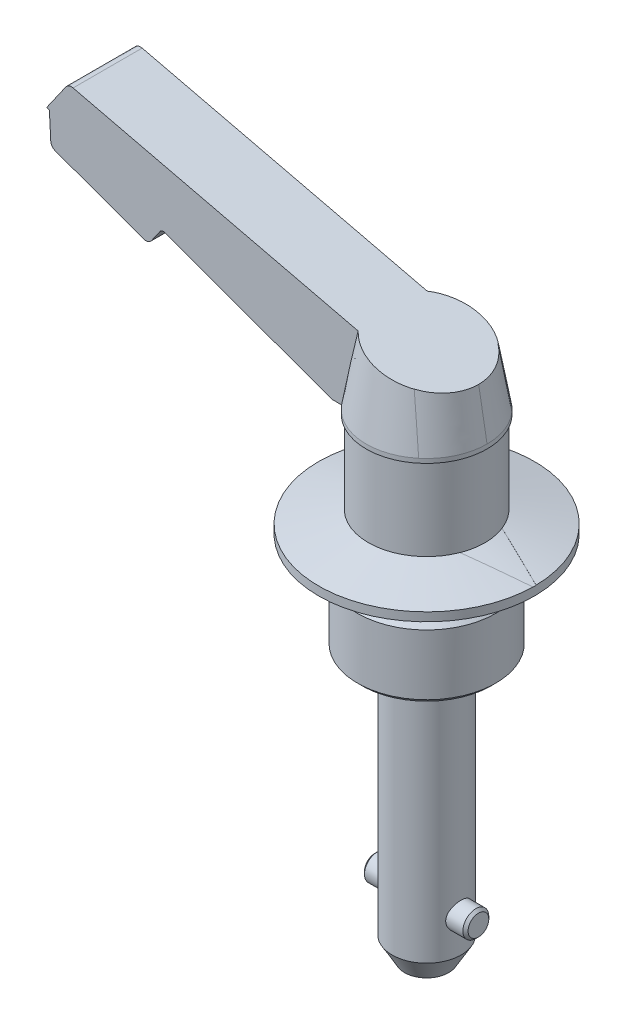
ISO-10303-21;
HEADER;
FILE_DESCRIPTION(('STEP AP214'),'2;1');
FILE_NAME('part.step','',(''),(''),'','','');
FILE_SCHEMA(('AUTOMOTIVE_DESIGN { 1 0 10303 214 1 1 1 1 }'));
ENDSEC;
DATA;
#1=APPLICATION_CONTEXT('core data for automotive mechanical design processes');
#2=APPLICATION_PROTOCOL_DEFINITION('international standard','automotive_design',2000,#1);
#3=PRODUCT_CONTEXT('',#1,'mechanical');
#4=PRODUCT('Part','Part','',(#3));
#5=PRODUCT_RELATED_PRODUCT_CATEGORY('part','',(#4));
#6=PRODUCT_DEFINITION_FORMATION('','',#4);
#7=PRODUCT_DEFINITION_CONTEXT('part definition',#1,'design');
#8=PRODUCT_DEFINITION('design','',#6,#7);
#9=PRODUCT_DEFINITION_SHAPE('','',#8);
#10=(LENGTH_UNIT() NAMED_UNIT(*) SI_UNIT(.MILLI.,.METRE.));
#11=(NAMED_UNIT(*) PLANE_ANGLE_UNIT() SI_UNIT($,.RADIAN.));
#12=(NAMED_UNIT(*) SI_UNIT($,.STERADIAN.) SOLID_ANGLE_UNIT());
#13=UNCERTAINTY_MEASURE_WITH_UNIT(LENGTH_MEASURE(1.E-05),#10,'distance_accuracy_value','');
#14=(GEOMETRIC_REPRESENTATION_CONTEXT(3) GLOBAL_UNCERTAINTY_ASSIGNED_CONTEXT((#13)) GLOBAL_UNIT_ASSIGNED_CONTEXT((#10,
#11,#12)) REPRESENTATION_CONTEXT('',''));
#15=CARTESIAN_POINT('',(0.,0.,0.));
#16=DIRECTION('',(0.,0.,1.));
#17=DIRECTION('',(1.,0.,0.));
#18=AXIS2_PLACEMENT_3D('',#15,#16,#17);
#19=CARTESIAN_POINT('',(0.,18.251996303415,0.));
#20=DIRECTION('',(0.,-1.,0.));
#21=DIRECTION('',(0.,0.,-1.));
#22=AXIS2_PLACEMENT_3D('',#19,#20,#21);
#23=CONICAL_SURFACE('',#22,6.65,1.31979364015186);
#24=CARTESIAN_POINT('',(0.,18.2263552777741,0.));
#25=DIRECTION('',(0.,-1.,0.));
#26=DIRECTION('',(0.,0.,-1.));
#27=AXIS2_PLACEMENT_3D('',#24,#25,#26);
#28=CIRCLE('',#27,6.75);
#29=CARTESIAN_POINT('',(6.29313374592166,18.2263552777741,-2.441099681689));
#30=VERTEX_POINT('',#29);
#31=CARTESIAN_POINT('',(6.29313374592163,18.2263552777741,2.44109968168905));
#32=VERTEX_POINT('',#31);
#33=EDGE_CURVE('E1136',#30,#32,#28,.F.);
#34=ORIENTED_EDGE('',*,*,#33,.F.);
#35=CARTESIAN_POINT('',(6.16731302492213,18.252036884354,-2.48689467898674));
#36=CARTESIAN_POINT('',(6.30010200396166,18.2250905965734,-2.43856344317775));
#37=CARTESIAN_POINT('',(6.43280189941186,18.1976524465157,-2.39026463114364));
#38=CARTESIAN_POINT('',(6.69804041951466,18.14191401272,-2.2937257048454));
#39=CARTESIAN_POINT('',(6.83057904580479,18.1136137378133,-2.24548558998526));
#40=CARTESIAN_POINT('',(7.22797113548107,18.0276037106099,-2.10084669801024));
#41=CARTESIAN_POINT('',(7.49261213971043,17.968782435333,-2.00452524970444));
#42=CARTESIAN_POINT('',(8.02141269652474,17.8489063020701,-1.81205758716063));
#43=CARTESIAN_POINT('',(8.28557230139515,17.787851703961,-1.71591135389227));
#44=CARTESIAN_POINT('',(8.81353581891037,17.6640123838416,-1.52374834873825));
#45=CARTESIAN_POINT('',(9.07733972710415,17.6012276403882,-1.42773157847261));
#46=CARTESIAN_POINT('',(9.86826913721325,17.4108853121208,-1.13985681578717));
#47=CARTESIAN_POINT('',(10.3949690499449,17.2813265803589,-0.948153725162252));
#48=CARTESIAN_POINT('',(11.1844878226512,17.0844504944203,-0.660792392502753));
#49=CARTESIAN_POINT('',(11.4475875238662,17.0183982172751,-0.565031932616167));
#50=CARTESIAN_POINT('',(11.9736299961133,16.8855900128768,-0.373568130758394));
#51=CARTESIAN_POINT('',(12.2365727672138,16.8188340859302,-0.277864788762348));
#52=CARTESIAN_POINT('',(12.499452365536,16.751796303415,-0.182184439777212));
#53=B_SPLINE_CURVE_WITH_KNOTS('',3,(#35,#36,#37,#38,#39,#40,#41,#42,#43,#44,#45,#46,#47,#48,#49,
#50,#51,#52),.UNSPECIFIED.,.F.,.F.,(4,2,2,2,2,2,2,2,4),(0.,0.431569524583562,0.863134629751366,
1.72622800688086,2.58922126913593,3.45222523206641,5.17804788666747,6.04105964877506,
6.90407103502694),.UNSPECIFIED.);
#54=CARTESIAN_POINT('',(12.4986681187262,16.751996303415,-0.182469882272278));
#55=VERTEX_POINT('',#54);
#56=EDGE_CURVE('E896',#30,#55,#53,.T.);
#57=ORIENTED_EDGE('',*,*,#56,.T.);
#58=CARTESIAN_POINT('',(0.,16.751996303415,0.));
#59=DIRECTION('',(0.,-1.,0.));
#60=DIRECTION('',(0.,0.,-1.));
#61=AXIS2_PLACEMENT_3D('',#58,#59,#60);
#62=CIRCLE('',#61,12.5);
#63=CARTESIAN_POINT('',(12.4986681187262,16.751996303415,0.182469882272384));
#64=VERTEX_POINT('',#63);
#65=EDGE_CURVE('E936',#64,#55,#62,.T.);
#66=ORIENTED_EDGE('',*,*,#65,.F.);
#67=CARTESIAN_POINT('',(12.499452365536,16.751796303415,0.182184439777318));
#68=CARTESIAN_POINT('',(12.2365727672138,16.8188340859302,0.277864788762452));
#69=CARTESIAN_POINT('',(11.9736299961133,16.8855900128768,0.373568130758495));
#70=CARTESIAN_POINT('',(11.4475875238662,17.0183982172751,0.565031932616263));
#71=CARTESIAN_POINT('',(11.1844878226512,17.0844504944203,0.660792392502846));
#72=CARTESIAN_POINT('',(10.3949690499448,17.2813265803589,0.948153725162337));
#73=CARTESIAN_POINT('',(9.86826913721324,17.4108853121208,1.13985681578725));
#74=CARTESIAN_POINT('',(9.07733972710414,17.6012276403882,1.42773157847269));
#75=CARTESIAN_POINT('',(8.81353581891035,17.6640123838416,1.52374834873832));
#76=CARTESIAN_POINT('',(8.28557230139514,17.787851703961,1.71591135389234));
#77=CARTESIAN_POINT('',(8.02141269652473,17.8489063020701,1.81205758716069));
#78=CARTESIAN_POINT('',(7.49261213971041,17.968782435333,2.00452524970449));
#79=CARTESIAN_POINT('',(7.22797113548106,18.0276037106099,2.1008466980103));
#80=CARTESIAN_POINT('',(6.83057904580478,18.1136137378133,2.24548558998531));
#81=CARTESIAN_POINT('',(6.69804041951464,18.14191401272,2.29372570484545));
#82=CARTESIAN_POINT('',(6.43280189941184,18.1976524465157,2.39026463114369));
#83=CARTESIAN_POINT('',(6.30010200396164,18.2250905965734,2.4385634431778));
#84=CARTESIAN_POINT('',(6.16731302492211,18.252036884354,2.48689467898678));
#85=B_SPLINE_CURVE_WITH_KNOTS('',3,(#67,#68,#69,#70,#71,#72,#73,#74,#75,#76,#77,#78,#79,#80,#81,
#82,#83,#84),.UNSPECIFIED.,.F.,.F.,(4,2,2,2,2,2,2,2,4),(0.,0.863011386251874,1.72602314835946,
3.45184580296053,4.31484976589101,5.17784302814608,6.04093640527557,6.47250151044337,
6.90407103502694),.UNSPECIFIED.);
#86=EDGE_CURVE('E888',#64,#32,#85,.T.);
#87=ORIENTED_EDGE('',*,*,#86,.T.);
#88=EDGE_LOOP('',(#34,#57,#66,#87));
#89=FACE_BOUND('',#88,.T.);
#90=ADVANCED_FACE('F16',(#89),#23,.T.);
#91=CARTESIAN_POINT('',(13.,15.7309963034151,0.));
#92=DIRECTION('',(0.342020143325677,0.,-0.939692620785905));
#93=DIRECTION('',(-0.939692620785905,0.,-0.342020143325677));
#94=AXIS2_PLACEMENT_3D('',#91,#92,#93);
#95=PLANE('',#94);
#96=DIRECTION('',(0.,1.,0.));
#97=VECTOR('',#96,1.);
#98=CARTESIAN_POINT('',(6.29313374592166,16.751996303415,-2.441099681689));
#99=LINE('',#98,#97);
#100=CARTESIAN_POINT('',(6.29313374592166,18.2160317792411,-2.441099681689));
#101=VERTEX_POINT('',#100);
#102=EDGE_CURVE('E917',#101,#30,#99,.T.);
#103=ORIENTED_EDGE('',*,*,#102,.F.);
#104=CARTESIAN_POINT('',(13.0002,16.6134163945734,7.27940469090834E-05));
#105=CARTESIAN_POINT('',(12.7165376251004,16.6861477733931,-0.1031718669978));
#106=CARTESIAN_POINT('',(12.4328096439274,16.7585879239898,-0.206440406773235));
#107=CARTESIAN_POINT('',(11.8651891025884,16.9027335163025,-0.413037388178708));
#108=CARTESIAN_POINT('',(11.5812965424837,16.9744389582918,-0.51636582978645));
#109=CARTESIAN_POINT('',(10.7293893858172,17.1882079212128,-0.8264346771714));
#110=CARTESIAN_POINT('',(10.1610776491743,17.3289415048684,-1.03328323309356));
#111=CARTESIAN_POINT('',(9.30765246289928,17.5357341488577,-1.34390459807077));
#112=CARTESIAN_POINT('',(9.02300115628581,17.6039509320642,-1.44750920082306));
#113=CARTESIAN_POINT('',(8.45330641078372,17.7384880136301,-1.65486113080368));
#114=CARTESIAN_POINT('',(8.16826297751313,17.8048083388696,-1.75860845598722));
#115=CARTESIAN_POINT('',(7.59763598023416,17.9349593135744,-1.96629969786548));
#116=CARTESIAN_POINT('',(7.31205235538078,17.9987896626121,-2.07024363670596));
#117=CARTESIAN_POINT('',(6.88318421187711,18.092006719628,-2.2263388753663));
#118=CARTESIAN_POINT('',(6.74014257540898,18.1226583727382,-2.27840177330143));
#119=CARTESIAN_POINT('',(6.45387287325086,18.182968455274,-2.38259542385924));
#120=CARTESIAN_POINT('',(6.31064480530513,18.2126268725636,-2.43472617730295));
#121=CARTESIAN_POINT('',(6.16731302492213,18.241713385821,-2.48689467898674));
#122=B_SPLINE_CURVE_WITH_KNOTS('',3,(#104,#105,#106,#107,#108,#109,#110,#111,#112,#113,#114,
#115,#116,#117,#118,#119,#120,#121),.UNSPECIFIED.,.F.,.F.,(4,2,2,2,2,2,2,2,4),(0.,
0.93151542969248,1.8630305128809,3.72583842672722,4.65735116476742,5.58885069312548,
6.52046226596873,6.98629062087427,7.45212466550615),.UNSPECIFIED.);
#123=CARTESIAN_POINT('',(12.4986681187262,16.7416728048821,-0.182469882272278));
#124=VERTEX_POINT('',#123);
#125=EDGE_CURVE('E909',#124,#101,#122,.T.);
#126=ORIENTED_EDGE('',*,*,#125,.F.);
#127=DIRECTION('',(0.,-1.,0.));
#128=VECTOR('',#127,1.);
#129=CARTESIAN_POINT('',(12.4986681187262,18.251996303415,-0.182469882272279));
#130=LINE('',#129,#128);
#131=EDGE_CURVE('E902',#55,#124,#130,.T.);
#132=ORIENTED_EDGE('',*,*,#131,.F.);
#133=ORIENTED_EDGE('',*,*,#56,.F.);
#134=EDGE_LOOP('',(#103,#126,#132,#133));
#135=FACE_BOUND('',#134,.T.);
#136=ADVANCED_FACE('F836',(#135),#95,.F.);
#137=CARTESIAN_POINT('',(0.,18.251996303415,0.));
#138=DIRECTION('',(0.,-1.,0.));
#139=DIRECTION('',(0.,0.,-1.));
#140=AXIS2_PLACEMENT_3D('',#137,#138,#139);
#141=CYLINDRICAL_SURFACE('',#140,12.5);
#142=ORIENTED_EDGE('',*,*,#65,.T.);
#143=ORIENTED_EDGE('',*,*,#131,.T.);
#144=CARTESIAN_POINT('',(0.,16.7416728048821,0.));
#145=DIRECTION('',(0.,-1.,0.));
#146=DIRECTION('',(0.,0.,-1.));
#147=AXIS2_PLACEMENT_3D('',#144,#145,#146);
#148=CIRCLE('',#147,12.5);
#149=CARTESIAN_POINT('',(12.4986681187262,16.7416728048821,0.182469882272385));
#150=VERTEX_POINT('',#149);
#151=EDGE_CURVE('E937',#124,#150,#148,.T.);
#152=ORIENTED_EDGE('',*,*,#151,.T.);
#153=DIRECTION('',(0.,-1.,0.));
#154=VECTOR('',#153,1.);
#155=CARTESIAN_POINT('',(12.4986681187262,18.251996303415,0.182469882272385));
#156=LINE('',#155,#154);
#157=EDGE_CURVE('E903',#150,#64,#156,.F.);
#158=ORIENTED_EDGE('',*,*,#157,.T.);
#159=EDGE_LOOP('',(#142,#143,#152,#158));
#160=FACE_BOUND('',#159,.T.);
#161=CARTESIAN_POINT('',(0.,15.7519963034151,0.));
#162=DIRECTION('',(0.,1.,0.));
#163=DIRECTION('',(0.,0.,1.));
#164=AXIS2_PLACEMENT_3D('',#161,#162,#163);
#165=CIRCLE('',#164,12.5);
#166=CARTESIAN_POINT('',(0.,15.7519963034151,12.5));
#167=VERTEX_POINT('',#166);
#168=EDGE_CURVE('E941',#167,#167,#165,.T.);
#169=ORIENTED_EDGE('',*,*,#168,.T.);
#170=EDGE_LOOP('',(#169));
#171=FACE_BOUND('',#170,.T.);
#172=ADVANCED_FACE('F828',(#160,#171),#141,.T.);
#173=CARTESIAN_POINT('',(13.,15.7309963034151,0.));
#174=DIRECTION('',(0.342020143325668,0.,0.939692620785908));
#175=DIRECTION('',(0.939692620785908,0.,-0.342020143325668));
#176=AXIS2_PLACEMENT_3D('',#173,#174,#175);
#177=PLANE('',#176);
#178=DIRECTION('',(0.,1.,0.));
#179=VECTOR('',#178,1.);
#180=CARTESIAN_POINT('',(6.29313374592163,16.751996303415,2.44109968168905));
#181=LINE('',#180,#179);
#182=CARTESIAN_POINT('',(6.29313374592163,18.2160317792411,2.44109968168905));
#183=VERTEX_POINT('',#182);
#184=EDGE_CURVE('E26',#32,#183,#181,.F.);
#185=ORIENTED_EDGE('',*,*,#184,.F.);
#186=ORIENTED_EDGE('',*,*,#86,.F.);
#187=ORIENTED_EDGE('',*,*,#157,.F.);
#188=CARTESIAN_POINT('',(6.16731302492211,18.241713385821,2.48689467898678));
#189=CARTESIAN_POINT('',(6.3106448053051,18.2126268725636,2.43472617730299));
#190=CARTESIAN_POINT('',(6.45387287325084,18.182968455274,2.38259542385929));
#191=CARTESIAN_POINT('',(6.74014257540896,18.1226583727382,2.27840177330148));
#192=CARTESIAN_POINT('',(6.88318421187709,18.092006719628,2.22633887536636));
#193=CARTESIAN_POINT('',(7.31205235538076,17.9987896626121,2.07024363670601));
#194=CARTESIAN_POINT('',(7.59763598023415,17.9349593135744,1.96629969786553));
#195=CARTESIAN_POINT('',(8.16826297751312,17.8048083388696,1.75860845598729));
#196=CARTESIAN_POINT('',(8.45330641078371,17.7384880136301,1.65486113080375));
#197=CARTESIAN_POINT('',(9.0230011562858,17.6039509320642,1.44750920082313));
#198=CARTESIAN_POINT('',(9.30765246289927,17.5357341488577,1.34390459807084));
#199=CARTESIAN_POINT('',(10.1610776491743,17.3289415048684,1.03328323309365));
#200=CARTESIAN_POINT('',(10.7293893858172,17.1882079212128,0.826434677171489));
#201=CARTESIAN_POINT('',(11.5812965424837,16.9744389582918,0.516365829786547));
#202=CARTESIAN_POINT('',(11.8651891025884,16.9027335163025,0.413037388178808));
#203=CARTESIAN_POINT('',(12.4328096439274,16.7585879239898,0.20644040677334));
#204=CARTESIAN_POINT('',(12.7165376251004,16.6861477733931,0.103171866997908));
#205=CARTESIAN_POINT('',(13.0002,16.6134163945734,-7.27940467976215E-05));
#206=B_SPLINE_CURVE_WITH_KNOTS('',3,(#188,#189,#190,#191,#192,#193,#194,#195,#196,#197,#198,
#199,#200,#201,#202,#203,#204,#205),.UNSPECIFIED.,.F.,.F.,(4,2,2,2,2,2,2,2,4),(0.,
0.465834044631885,0.931662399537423,1.86327397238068,2.79477350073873,3.72628623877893,
5.58909415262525,6.52060923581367,7.45212466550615),.UNSPECIFIED.);
#207=EDGE_CURVE('E916',#183,#150,#206,.T.);
#208=ORIENTED_EDGE('',*,*,#207,.F.);
#209=EDGE_LOOP('',(#185,#186,#187,#208));
#210=FACE_BOUND('',#209,.T.);
#211=ADVANCED_FACE('F819',(#210),#177,.F.);
#212=CARTESIAN_POINT('',(0.,18.2423096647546,0.));
#213=DIRECTION('',(0.,-1.,0.));
#214=DIRECTION('',(0.,0.,-1.));
#215=AXIS2_PLACEMENT_3D('',#212,#213,#214);
#216=CONICAL_SURFACE('',#215,6.64751624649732,1.31979364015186);
#217=CARTESIAN_POINT('',(0.,18.2160317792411,0.));
#218=DIRECTION('',(0.,-1.,0.));
#219=DIRECTION('',(0.,0.,-1.));
#220=AXIS2_PLACEMENT_3D('',#217,#218,#219);
#221=CIRCLE('',#220,6.75);
#222=EDGE_CURVE('E1117',#183,#101,#221,.F.);
#223=ORIENTED_EDGE('',*,*,#222,.F.);
#224=ORIENTED_EDGE('',*,*,#207,.T.);
#225=ORIENTED_EDGE('',*,*,#151,.F.);
#226=ORIENTED_EDGE('',*,*,#125,.T.);
#227=EDGE_LOOP('',(#223,#224,#225,#226));
#228=FACE_BOUND('',#227,.T.);
#229=ADVANCED_FACE('F810',(#228),#216,.T.);
#230=CARTESIAN_POINT('',(0.,15.7519963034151,0.));
#231=DIRECTION('',(0.,1.,0.));
#232=DIRECTION('',(0.,0.,1.));
#233=AXIS2_PLACEMENT_3D('',#230,#231,#232);
#234=PLANE('',#233);
#235=CARTESIAN_POINT('',(0.,15.7519963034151,0.));
#236=DIRECTION('',(0.,1.,0.));
#237=DIRECTION('',(-1.,0.,0.));
#238=AXIS2_PLACEMENT_3D('',#235,#236,#237);
#239=CIRCLE('',#238,5.25);
#240=CARTESIAN_POINT('',(-5.25,15.7519963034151,0.));
#241=VERTEX_POINT('',#240);
#242=EDGE_CURVE('E10',#241,#241,#239,.T.);
#243=ORIENTED_EDGE('',*,*,#242,.T.);
#244=EDGE_LOOP('',(#243));
#245=FACE_BOUND('',#244,.T.);
#246=ORIENTED_EDGE('',*,*,#168,.F.);
#247=EDGE_LOOP('',(#246));
#248=FACE_BOUND('',#247,.T.);
#249=ADVANCED_FACE('F385',(#245,#248),#234,.F.);
#250=CARTESIAN_POINT('',(3.74209761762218,32.3811800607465,5.02011689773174));
#251=DIRECTION('',(0.,-0.0890197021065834,-0.996029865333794));
#252=DIRECTION('',(0.,-0.996029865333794,0.0890197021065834));
#253=AXIS2_PLACEMENT_3D('',#250,#251,#252);
#254=PLANE('',#253);
#255=DIRECTION('',(-0.172319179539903,0.981130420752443,-0.0876880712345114));
#256=VECTOR('',#255,1.);
#257=CARTESIAN_POINT('',(3.74209761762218,32.3811800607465,5.02011689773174));
#258=LINE('',#257,#256);
#259=CARTESIAN_POINT('',(4.46731981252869,28.2519963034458,5.38916075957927));
#260=VERTEX_POINT('',#259);
#261=CARTESIAN_POINT('',(3.39086009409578,34.381014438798,4.8413826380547));
#262=VERTEX_POINT('',#261);
#263=EDGE_CURVE('E1148',#260,#262,#258,.T.);
#264=ORIENTED_EDGE('',*,*,#263,.T.);
#265=DIRECTION('',(0.972547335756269,-0.231781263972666,0.0207153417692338));
#266=VECTOR('',#265,1.);
#267=CARTESIAN_POINT('',(4.17747757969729,34.1935446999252,4.85813765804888));
#268=LINE('',#267,#266);
#269=CARTESIAN_POINT('',(3.40639365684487,34.3773124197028,4.8417135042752));
#270=VERTEX_POINT('',#269);
#271=EDGE_CURVE('E1113',#262,#270,#268,.T.);
#272=ORIENTED_EDGE('',*,*,#271,.T.);
#273=CARTESIAN_POINT('',(4.46735350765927,28.2517963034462,5.38917863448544));
#274=CARTESIAN_POINT('',(4.35123065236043,28.9408492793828,5.32759484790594));
#275=CARTESIAN_POINT('',(4.23435228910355,29.6297775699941,5.2660222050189));
#276=CARTESIAN_POINT('',(3.99849210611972,31.0072643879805,5.14290996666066));
#277=CARTESIAN_POINT('',(3.87951032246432,31.6958229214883,5.08137037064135));
#278=CARTESIAN_POINT('',(3.63884615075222,33.0724778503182,4.95833248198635));
#279=CARTESIAN_POINT('',(3.51716374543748,33.760574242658,4.89683418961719));
#280=CARTESIAN_POINT('',(3.33188262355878,34.7922337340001,4.80463010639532));
#281=CARTESIAN_POINT('',(3.26966211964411,35.1360423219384,4.77390237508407));
#282=CARTESIAN_POINT('',(3.1441207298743,35.8234610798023,4.71246464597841));
#283=CARTESIAN_POINT('',(3.08079984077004,36.1670712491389,4.68175464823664));
#284=CARTESIAN_POINT('',(3.01683817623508,36.5105638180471,4.65105516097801));
#285=B_SPLINE_CURVE_WITH_KNOTS('',3,(#273,#274,#275,#276,#277,#278,#279,#280,#281,#282,#283,
#284),.UNSPECIFIED.,.F.,.F.,(4,2,2,2,2,4),(0.,2.10443524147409,4.20883442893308,
6.31324706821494,7.36547139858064,8.41769883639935),.UNSPECIFIED.);
#286=EDGE_CURVE('E966',#260,#270,#285,.T.);
#287=ORIENTED_EDGE('',*,*,#286,.F.);
#288=EDGE_LOOP('',(#264,#272,#287));
#289=FACE_BOUND('',#288,.T.);
#290=ADVANCED_FACE('F793',(#289),#254,.T.);
#291=CARTESIAN_POINT('',(7.82049563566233,32.3811800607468,-4.65107303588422));
#292=DIRECTION('',(0.,0.,1.));
#293=DIRECTION('',(1.,0.,0.));
#294=AXIS2_PLACEMENT_3D('',#291,#292,#293);
#295=PLANE('',#294);
#296=CARTESIAN_POINT('',(1.37899907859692,40.4384598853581,-4.65107303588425));
#297=CARTESIAN_POINT('',(1.41863162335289,40.3745366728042,-4.65107303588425));
#298=CARTESIAN_POINT('',(1.45715110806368,40.3099400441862,-4.65107303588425));
#299=CARTESIAN_POINT('',(1.53224842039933,40.1796475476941,-4.65107303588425));
#300=CARTESIAN_POINT('',(1.56882673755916,40.1139519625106,-4.65107303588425));
#301=CARTESIAN_POINT('',(1.67604016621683,39.9156597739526,-4.65107303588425));
#302=CARTESIAN_POINT('',(1.7442251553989,39.7817399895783,-4.65107303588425));
#303=CARTESIAN_POINT('',(1.87546780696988,39.5117996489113,-4.65107303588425));
#304=CARTESIAN_POINT('',(1.93853624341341,39.3757842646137,-4.65107303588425));
#305=CARTESIAN_POINT('',(2.06077046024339,39.1019747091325,-4.65107303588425));
#306=CARTESIAN_POINT('',(2.11993518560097,38.9641800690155,-4.65107303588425));
#307=CARTESIAN_POINT('',(2.23488069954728,38.6877734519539,-4.65107303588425));
#308=CARTESIAN_POINT('',(2.2906728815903,38.5491661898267,-4.65107303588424));
#309=CARTESIAN_POINT('',(2.39963378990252,38.2709436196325,-4.65107303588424));
#310=CARTESIAN_POINT('',(2.45280276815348,38.1313284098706,-4.65107303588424));
#311=CARTESIAN_POINT('',(2.60909080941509,37.7110816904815,-4.65107303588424));
#312=CARTESIAN_POINT('',(2.70891870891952,37.4292262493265,-4.65107303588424));
#313=CARTESIAN_POINT('',(2.90167944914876,36.8645427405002,-4.65107303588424));
#314=CARTESIAN_POINT('',(2.9946400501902,36.5817240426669,-4.65107303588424));
#315=CARTESIAN_POINT('',(3.17555741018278,36.0145683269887,-4.65107303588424));
#316=CARTESIAN_POINT('',(3.26351532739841,35.7302316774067,-4.65107303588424));
#317=CARTESIAN_POINT('',(3.43553953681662,35.1600988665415,-4.65107303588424));
#318=CARTESIAN_POINT('',(3.5196021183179,34.8743015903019,-4.65107303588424));
#319=CARTESIAN_POINT('',(3.68447910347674,34.3017563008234,-4.65107303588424));
#320=CARTESIAN_POINT('',(3.76529331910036,34.0150082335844,-4.65107303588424));
#321=CARTESIAN_POINT('',(3.94446679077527,33.3675936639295,-4.65107303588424));
#322=CARTESIAN_POINT('',(4.04204881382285,33.0067123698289,-4.65107303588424));
#323=CARTESIAN_POINT('',(4.23373024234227,32.2841365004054,-4.65107303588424));
#324=CARTESIAN_POINT('',(4.32783060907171,31.9224421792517,-4.65107303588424));
#325=CARTESIAN_POINT('',(4.5132801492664,31.1978875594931,-4.65107303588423));
#326=CARTESIAN_POINT('',(4.60462588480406,30.8350263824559,-4.65107303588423));
#327=CARTESIAN_POINT('',(4.7849103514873,30.1086738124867,-4.65107303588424));
#328=CARTESIAN_POINT('',(4.87384887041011,29.745182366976,-4.65107303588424));
#329=CARTESIAN_POINT('',(5.07540465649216,28.9112213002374,-4.65107303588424));
#330=CARTESIAN_POINT('',(5.18733187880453,28.4405849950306,-4.65107303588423));
#331=CARTESIAN_POINT('',(5.40834264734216,27.4986444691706,-4.65107303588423));
#332=CARTESIAN_POINT('',(5.51742618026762,27.0273402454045,-4.65107303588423));
#333=CARTESIAN_POINT('',(5.84111309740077,25.6126244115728,-4.65107303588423));
#334=CARTESIAN_POINT('',(6.0521555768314,24.6683980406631,-4.65107303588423));
#335=CARTESIAN_POINT('',(6.46666688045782,22.7813887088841,-4.65107303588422));
#336=CARTESIAN_POINT('',(6.67015733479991,21.8386104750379,-4.65107303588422));
#337=CARTESIAN_POINT('',(6.97144162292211,20.4236221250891,-4.65107303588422));
#338=CARTESIAN_POINT('',(7.0712093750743,19.9518310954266,-4.65107303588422));
#339=CARTESIAN_POINT('',(7.26957513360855,19.008004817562,-4.65107303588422));
#340=CARTESIAN_POINT('',(7.36817314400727,18.5359695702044,-4.65107303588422));
#341=CARTESIAN_POINT('',(7.46625966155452,18.0638281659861,-4.65107303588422));
#342=B_SPLINE_CURVE_WITH_KNOTS('',3,(#296,#297,#298,#299,#300,#301,#302,#303,#304,#305,#306,
#307,#308,#309,#310,#311,#312,#313,#314,#315,#316,#317,#318,#319,#320,#321,#322,#323,#324,#325,
#326,#327,#328,#329,#330,#331,#332,#333,#334,#335,#336,#337,#338,#339,#340,#341),.UNSPECIFIED.,
.F.,.F.,(4,2,2,2,2,2,2,2,2,2,2,2,2,2,2,2,2,2,2,2,2,2,4),(0.,0.22560474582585,0.451152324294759,
0.901834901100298,1.35154240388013,1.80137095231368,2.24958345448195,2.69775281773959,
3.594665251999,4.48772729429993,5.38058171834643,6.2742698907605,7.16800972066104,
8.28951244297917,9.41070318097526,10.533239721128,11.6558749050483,13.1071512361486,
14.5584343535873,17.4609648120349,20.3544139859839,21.8010859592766,23.2477529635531),.UNSPECIFIED.);
#343=CARTESIAN_POINT('',(3.68103331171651,34.3118592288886,-4.65107303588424));
#344=VERTEX_POINT('',#343);
#345=CARTESIAN_POINT('',(5.23139748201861,28.2519963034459,-4.65107303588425));
#346=VERTEX_POINT('',#345);
#347=EDGE_CURVE('E1107',#344,#346,#342,.T.);
#348=ORIENTED_EDGE('',*,*,#347,.F.);
#349=DIRECTION('',(-0.972756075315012,0.23183101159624,0.));
#350=VECTOR('',#349,1.);
#351=CARTESIAN_POINT('',(8.03341483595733,33.2745827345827,-4.65107303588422));
#352=LINE('',#351,#350);
#353=CARTESIAN_POINT('',(3.60132106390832,34.3308565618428,-4.65107303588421));
#354=VERTEX_POINT('',#353);
#355=EDGE_CURVE('E1179',#344,#354,#352,.T.);
#356=ORIENTED_EDGE('',*,*,#355,.T.);
#357=DIRECTION('',(0.259004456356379,-0.965876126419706,0.));
#358=VECTOR('',#357,1.);
#359=CARTESIAN_POINT('',(4.12413645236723,32.3811800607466,-4.65107303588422));
#360=LINE('',#359,#358);
#361=EDGE_CURVE('E975',#354,#346,#360,.T.);
#362=ORIENTED_EDGE('',*,*,#361,.T.);
#363=EDGE_LOOP('',(#348,#356,#362));
#364=FACE_BOUND('',#363,.T.);
#365=ADVANCED_FACE('F784',(#364),#295,.T.);
#366=CARTESIAN_POINT('',(-37.1396325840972,43.2179935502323,-4.00000000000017));
#367=DIRECTION('',(0.,0.,1.));
#368=DIRECTION('',(1.,0.,0.));
#369=AXIS2_PLACEMENT_3D('',#366,#367,#368);
#370=CYLINDRICAL_SURFACE('',#369,0.8);
#371=DIRECTION('',(0.,0.,1.));
#372=VECTOR('',#371,1.);
#373=CARTESIAN_POINT('',(-36.9541677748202,43.9961984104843,-4.00000000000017));
#374=LINE('',#373,#372);
#375=CARTESIAN_POINT('',(-36.9541677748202,43.9961984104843,-4.00000000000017));
#376=VERTEX_POINT('',#375);
#377=CARTESIAN_POINT('',(-36.9541677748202,43.9961984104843,3.99999999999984));
#378=VERTEX_POINT('',#377);
#379=EDGE_CURVE('E1051',#376,#378,#374,.T.);
#380=ORIENTED_EDGE('',*,*,#379,.F.);
#381=CARTESIAN_POINT('',(-37.1396325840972,43.2179935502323,-4.00000000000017));
#382=DIRECTION('',(0.,0.,-1.));
#383=DIRECTION('',(-1.,0.,0.));
#384=AXIS2_PLACEMENT_3D('',#381,#382,#383);
#385=CIRCLE('',#384,0.8);
#386=CARTESIAN_POINT('',(-37.7949542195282,43.6768546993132,-4.00000000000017));
#387=VERTEX_POINT('',#386);
#388=EDGE_CURVE('E1022',#387,#376,#385,.T.);
#389=ORIENTED_EDGE('',*,*,#388,.F.);
#390=DIRECTION('',(0.,0.,1.));
#391=VECTOR('',#390,1.);
#392=CARTESIAN_POINT('',(-37.7949542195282,43.6768546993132,-4.00000000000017));
#393=LINE('',#392,#391);
#394=CARTESIAN_POINT('',(-37.7949542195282,43.6768546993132,3.99999999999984));
#395=VERTEX_POINT('',#394);
#396=EDGE_CURVE('E1054',#387,#395,#393,.T.);
#397=ORIENTED_EDGE('',*,*,#396,.T.);
#398=CARTESIAN_POINT('',(-37.1396325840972,43.2179935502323,3.99999999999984));
#399=DIRECTION('',(0.,0.,-1.));
#400=DIRECTION('',(-1.,0.,0.));
#401=AXIS2_PLACEMENT_3D('',#398,#399,#400);
#402=CIRCLE('',#401,0.8);
#403=EDGE_CURVE('E987',#395,#378,#402,.T.);
#404=ORIENTED_EDGE('',*,*,#403,.T.);
#405=EDGE_LOOP('',(#380,#389,#397,#404));
#406=FACE_BOUND('',#405,.T.);
#407=ADVANCED_FACE('F775',(#406),#370,.T.);
#408=CARTESIAN_POINT('',(-37.7949542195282,43.6768546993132,-4.00000000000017));
#409=DIRECTION('',(-0.819152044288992,0.573576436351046,0.));
#410=DIRECTION('',(0.573576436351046,0.819152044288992,0.));
#411=AXIS2_PLACEMENT_3D('',#408,#409,#410);
#412=PLANE('',#411);
#413=ORIENTED_EDGE('',*,*,#396,.F.);
#414=DIRECTION('',(-0.573576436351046,-0.819152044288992,0.));
#415=VECTOR('',#414,1.);
#416=CARTESIAN_POINT('',(-37.7949542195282,43.6768546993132,-4.00000000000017));
#417=LINE('',#416,#415);
#418=CARTESIAN_POINT('',(-40.,40.5277229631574,-4.00000000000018));
#419=VERTEX_POINT('',#418);
#420=EDGE_CURVE('E1025',#387,#419,#417,.T.);
#421=ORIENTED_EDGE('',*,*,#420,.T.);
#422=DIRECTION('',(0.,0.,1.));
#423=VECTOR('',#422,1.);
#424=CARTESIAN_POINT('',(-40.,40.5277229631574,-4.00000000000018));
#425=LINE('',#424,#423);
#426=CARTESIAN_POINT('',(-40.,40.5277229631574,3.99999999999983));
#427=VERTEX_POINT('',#426);
#428=EDGE_CURVE('E1056',#419,#427,#425,.T.);
#429=ORIENTED_EDGE('',*,*,#428,.T.);
#430=DIRECTION('',(-0.573576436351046,-0.819152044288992,0.));
#431=VECTOR('',#430,1.);
#432=CARTESIAN_POINT('',(-37.7949542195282,43.6768546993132,3.99999999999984));
#433=LINE('',#432,#431);
#434=EDGE_CURVE('E990',#395,#427,#433,.T.);
#435=ORIENTED_EDGE('',*,*,#434,.F.);
#436=EDGE_LOOP('',(#413,#421,#429,#435));
#437=FACE_BOUND('',#436,.T.);
#438=ADVANCED_FACE('F766',(#437),#412,.T.);
#439=CARTESIAN_POINT('',(-39.6999999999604,40.4185280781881,-4.00000000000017));
#440=DIRECTION('',(0.342030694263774,0.939688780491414,0.));
#441=DIRECTION('',(0.939688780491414,-0.342030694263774,0.));
#442=AXIS2_PLACEMENT_3D('',#439,#440,#441);
#443=PLANE('',#442);
#444=ORIENTED_EDGE('',*,*,#428,.F.);
#445=DIRECTION('',(-0.939688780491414,0.342030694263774,0.));
#446=VECTOR('',#445,1.);
#447=CARTESIAN_POINT('',(-39.6999999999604,40.4185280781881,-4.00000000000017));
#448=LINE('',#447,#446);
#449=CARTESIAN_POINT('',(-39.6999999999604,40.4185280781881,-4.00000000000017));
#450=VERTEX_POINT('',#449);
#451=EDGE_CURVE('E1028',#450,#419,#448,.T.);
#452=ORIENTED_EDGE('',*,*,#451,.F.);
#453=DIRECTION('',(0.,0.,1.));
#454=VECTOR('',#453,1.);
#455=CARTESIAN_POINT('',(-39.6999999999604,40.4185280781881,-4.00000000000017));
#456=LINE('',#455,#454);
#457=CARTESIAN_POINT('',(-39.6999999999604,40.4185280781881,3.99999999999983));
#458=VERTEX_POINT('',#457);
#459=EDGE_CURVE('E1058',#450,#458,#456,.T.);
#460=ORIENTED_EDGE('',*,*,#459,.T.);
#461=DIRECTION('',(-0.939688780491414,0.342030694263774,0.));
#462=VECTOR('',#461,1.);
#463=CARTESIAN_POINT('',(-39.6999999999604,40.4185280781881,3.99999999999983));
#464=LINE('',#463,#462);
#465=EDGE_CURVE('E993',#458,#427,#464,.T.);
#466=ORIENTED_EDGE('',*,*,#465,.T.);
#467=EDGE_LOOP('',(#444,#452,#460,#466));
#468=FACE_BOUND('',#467,.T.);
#469=ADVANCED_FACE('F757',(#468),#443,.F.);
#470=CARTESIAN_POINT('',(-39.6999999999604,40.4185280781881,-4.00000000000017));
#471=DIRECTION('',(-0.998629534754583,-0.0523359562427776,0.));
#472=DIRECTION('',(-0.0523359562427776,0.998629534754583,0.));
#473=AXIS2_PLACEMENT_3D('',#470,#471,#472);
#474=PLANE('',#473);
#475=ORIENTED_EDGE('',*,*,#459,.F.);
#476=DIRECTION('',(0.0523359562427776,-0.998629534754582,0.));
#477=VECTOR('',#476,1.);
#478=CARTESIAN_POINT('',(-39.6999999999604,40.4185280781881,-4.00000000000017));
#479=LINE('',#478,#477);
#480=CARTESIAN_POINT('',(-39.5400886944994,37.3672386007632,-4.00000000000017));
#481=VERTEX_POINT('',#480);
#482=EDGE_CURVE('E1031',#450,#481,#479,.T.);
#483=ORIENTED_EDGE('',*,*,#482,.T.);
#484=DIRECTION('',(0.,0.,1.));
#485=VECTOR('',#484,1.);
#486=CARTESIAN_POINT('',(-39.5400886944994,37.3672386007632,-4.00000000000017));
#487=LINE('',#486,#485);
#488=CARTESIAN_POINT('',(-39.5400886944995,37.3672386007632,3.99999999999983));
#489=VERTEX_POINT('',#488);
#490=EDGE_CURVE('E1060',#481,#489,#487,.T.);
#491=ORIENTED_EDGE('',*,*,#490,.T.);
#492=DIRECTION('',(0.0523359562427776,-0.998629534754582,0.));
#493=VECTOR('',#492,1.);
#494=CARTESIAN_POINT('',(-39.6999999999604,40.4185280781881,3.99999999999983));
#495=LINE('',#494,#493);
#496=EDGE_CURVE('E996',#458,#489,#495,.T.);
#497=ORIENTED_EDGE('',*,*,#496,.F.);
#498=EDGE_LOOP('',(#475,#483,#491,#497));
#499=FACE_BOUND('',#498,.T.);
#500=ADVANCED_FACE('F748',(#499),#474,.T.);
#501=CARTESIAN_POINT('',(-38.7411850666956,37.4091073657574,-4.00000000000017));
#502=DIRECTION('',(0.,0.,1.));
#503=DIRECTION('',(1.,0.,0.));
#504=AXIS2_PLACEMENT_3D('',#501,#502,#503);
#505=CYLINDRICAL_SURFACE('',#504,0.8);
#506=ORIENTED_EDGE('',*,*,#490,.F.);
#507=CARTESIAN_POINT('',(-38.7411850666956,37.4091073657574,-4.00000000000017));
#508=DIRECTION('',(0.,0.,-1.));
#509=DIRECTION('',(-1.,0.,0.));
#510=AXIS2_PLACEMENT_3D('',#507,#508,#509);
#511=CIRCLE('',#510,0.8);
#512=CARTESIAN_POINT('',(-39.0148011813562,36.6573532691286,-4.00000000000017));
#513=VERTEX_POINT('',#512);
#514=EDGE_CURVE('E1034',#513,#481,#511,.T.);
#515=ORIENTED_EDGE('',*,*,#514,.F.);
#516=DIRECTION('',(0.,0.,1.));
#517=VECTOR('',#516,1.);
#518=CARTESIAN_POINT('',(-39.0148011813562,36.6573532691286,-4.00000000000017));
#519=LINE('',#518,#517);
#520=CARTESIAN_POINT('',(-39.0148011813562,36.6573532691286,3.99999999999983));
#521=VERTEX_POINT('',#520);
#522=EDGE_CURVE('E1062',#513,#521,#519,.T.);
#523=ORIENTED_EDGE('',*,*,#522,.T.);
#524=CARTESIAN_POINT('',(-38.7411850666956,37.4091073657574,3.99999999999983));
#525=DIRECTION('',(0.,0.,-1.));
#526=DIRECTION('',(-1.,0.,0.));
#527=AXIS2_PLACEMENT_3D('',#524,#525,#526);
#528=CIRCLE('',#527,0.8);
#529=EDGE_CURVE('E999',#521,#489,#528,.T.);
#530=ORIENTED_EDGE('',*,*,#529,.T.);
#531=EDGE_LOOP('',(#506,#515,#523,#530));
#532=FACE_BOUND('',#531,.T.);
#533=ADVANCED_FACE('F739',(#532),#505,.T.);
#534=CARTESIAN_POINT('',(-39.0148011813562,36.6573532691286,-4.00000000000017));
#535=DIRECTION('',(-0.342020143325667,-0.939692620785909,0.));
#536=DIRECTION('',(-0.939692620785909,0.342020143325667,0.));
#537=AXIS2_PLACEMENT_3D('',#534,#535,#536);
#538=PLANE('',#537);
#539=ORIENTED_EDGE('',*,*,#522,.F.);
#540=DIRECTION('',(0.939692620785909,-0.342020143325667,0.));
#541=VECTOR('',#540,1.);
#542=CARTESIAN_POINT('',(-39.0148011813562,36.6573532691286,-4.00000000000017));
#543=LINE('',#542,#541);
#544=CARTESIAN_POINT('',(-28.7942536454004,32.9373781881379,-4.00000000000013));
#545=VERTEX_POINT('',#544);
#546=EDGE_CURVE('E1037',#513,#545,#543,.T.);
#547=ORIENTED_EDGE('',*,*,#546,.T.);
#548=DIRECTION('',(0.,0.,1.));
#549=VECTOR('',#548,1.);
#550=CARTESIAN_POINT('',(-28.7942536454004,32.9373781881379,-4.00000000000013));
#551=LINE('',#550,#549);
#552=CARTESIAN_POINT('',(-28.7942536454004,32.9373781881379,3.99999999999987));
#553=VERTEX_POINT('',#552);
#554=EDGE_CURVE('E1064',#545,#553,#551,.T.);
#555=ORIENTED_EDGE('',*,*,#554,.T.);
#556=DIRECTION('',(0.939692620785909,-0.342020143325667,0.));
#557=VECTOR('',#556,1.);
#558=CARTESIAN_POINT('',(-39.0148011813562,36.6573532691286,3.99999999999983));
#559=LINE('',#558,#557);
#560=EDGE_CURVE('E1002',#521,#553,#559,.T.);
#561=ORIENTED_EDGE('',*,*,#560,.F.);
#562=EDGE_LOOP('',(#539,#547,#555,#561));
#563=FACE_BOUND('',#562,.T.);
#564=ADVANCED_FACE('F730',(#563),#538,.T.);
#565=CARTESIAN_POINT('',(-28.5206375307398,33.6891322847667,-4.00000000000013));
#566=DIRECTION('',(0.,0.,1.));
#567=DIRECTION('',(1.,0.,0.));
#568=AXIS2_PLACEMENT_3D('',#565,#566,#567);
#569=CYLINDRICAL_SURFACE('',#568,0.8);
#570=ORIENTED_EDGE('',*,*,#554,.F.);
#571=CARTESIAN_POINT('',(-28.5206375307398,33.6891322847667,-4.00000000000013));
#572=DIRECTION('',(0.,0.,-1.));
#573=DIRECTION('',(-1.,0.,0.));
#574=AXIS2_PLACEMENT_3D('',#571,#572,#573);
#575=CIRCLE('',#574,0.8);
#576=CARTESIAN_POINT('',(-27.8653158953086,33.2302711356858,-4.00000000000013));
#577=VERTEX_POINT('',#576);
#578=EDGE_CURVE('E1040',#577,#545,#575,.T.);
#579=ORIENTED_EDGE('',*,*,#578,.F.);
#580=DIRECTION('',(0.,0.,1.));
#581=VECTOR('',#580,1.);
#582=CARTESIAN_POINT('',(-27.8653158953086,33.2302711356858,-4.00000000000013));
#583=LINE('',#582,#581);
#584=CARTESIAN_POINT('',(-27.8653158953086,33.2302711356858,3.99999999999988));
#585=VERTEX_POINT('',#584);
#586=EDGE_CURVE('E1066',#577,#585,#583,.T.);
#587=ORIENTED_EDGE('',*,*,#586,.T.);
#588=CARTESIAN_POINT('',(-28.5206375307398,33.6891322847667,3.99999999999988));
#589=DIRECTION('',(0.,0.,-1.));
#590=DIRECTION('',(-1.,0.,0.));
#591=AXIS2_PLACEMENT_3D('',#588,#589,#590);
#592=CIRCLE('',#591,0.8);
#593=EDGE_CURVE('E1005',#585,#553,#592,.T.);
#594=ORIENTED_EDGE('',*,*,#593,.T.);
#595=EDGE_LOOP('',(#570,#579,#587,#594));
#596=FACE_BOUND('',#595,.T.);
#597=ADVANCED_FACE('F721',(#596),#569,.T.);
#598=CARTESIAN_POINT('',(-27.8653158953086,33.2302711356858,-4.00000000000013));
#599=DIRECTION('',(0.819152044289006,-0.573576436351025,0.));
#600=DIRECTION('',(-0.573576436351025,-0.819152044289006,0.));
#601=AXIS2_PLACEMENT_3D('',#598,#599,#600);
#602=PLANE('',#601);
#603=ORIENTED_EDGE('',*,*,#586,.F.);
#604=DIRECTION('',(0.573576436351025,0.819152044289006,0.));
#605=VECTOR('',#604,1.);
#606=CARTESIAN_POINT('',(-27.8653158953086,33.2302711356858,-4.00000000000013));
#607=LINE('',#606,#605);
#608=CARTESIAN_POINT('',(-26.860594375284,34.6651621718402,-4.00000000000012));
#609=VERTEX_POINT('',#608);
#610=EDGE_CURVE('E1043',#577,#609,#607,.T.);
#611=ORIENTED_EDGE('',*,*,#610,.T.);
#612=DIRECTION('',(0.,0.,1.));
#613=VECTOR('',#612,1.);
#614=CARTESIAN_POINT('',(-26.860594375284,34.6651621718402,-4.00000000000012));
#615=LINE('',#614,#613);
#616=CARTESIAN_POINT('',(-26.860594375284,34.6651621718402,3.99999999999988));
#617=VERTEX_POINT('',#616);
#618=EDGE_CURVE('E1068',#609,#617,#615,.T.);
#619=ORIENTED_EDGE('',*,*,#618,.T.);
#620=DIRECTION('',(0.573576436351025,0.819152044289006,0.));
#621=VECTOR('',#620,1.);
#622=CARTESIAN_POINT('',(-27.8653158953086,33.2302711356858,3.99999999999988));
#623=LINE('',#622,#621);
#624=EDGE_CURVE('E1008',#585,#617,#623,.T.);
#625=ORIENTED_EDGE('',*,*,#624,.F.);
#626=EDGE_LOOP('',(#603,#611,#619,#625));
#627=FACE_BOUND('',#626,.T.);
#628=ADVANCED_FACE('F712',(#627),#602,.T.);
#629=CARTESIAN_POINT('',(-26.5329335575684,34.4357315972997,-4.00000000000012));
#630=DIRECTION('',(0.,0.,1.));
#631=DIRECTION('',(1.,0.,0.));
#632=AXIS2_PLACEMENT_3D('',#629,#630,#631);
#633=CYLINDRICAL_SURFACE('',#632,0.4);
#634=ORIENTED_EDGE('',*,*,#618,.F.);
#635=CARTESIAN_POINT('',(-26.5329335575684,34.4357315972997,-4.00000000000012));
#636=DIRECTION('',(0.,0.,-1.));
#637=DIRECTION('',(-1.,0.,0.));
#638=AXIS2_PLACEMENT_3D('',#635,#636,#637);
#639=CIRCLE('',#638,0.4);
#640=CARTESIAN_POINT('',(-26.3961255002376,34.8116086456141,-4.00000000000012));
#641=VERTEX_POINT('',#640);
#642=EDGE_CURVE('E1011',#609,#641,#639,.T.);
#643=ORIENTED_EDGE('',*,*,#642,.T.);
#644=DIRECTION('',(0.,0.,1.));
#645=VECTOR('',#644,1.);
#646=CARTESIAN_POINT('',(-26.3961255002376,34.8116086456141,-4.00000000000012));
#647=LINE('',#646,#645);
#648=CARTESIAN_POINT('',(-26.3961255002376,34.8116086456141,3.99999999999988));
#649=VERTEX_POINT('',#648);
#650=EDGE_CURVE('E1046',#641,#649,#647,.T.);
#651=ORIENTED_EDGE('',*,*,#650,.T.);
#652=CARTESIAN_POINT('',(-26.5329335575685,34.4357315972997,3.99999999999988));
#653=DIRECTION('',(0.,0.,-1.));
#654=DIRECTION('',(-1.,0.,0.));
#655=AXIS2_PLACEMENT_3D('',#652,#653,#654);
#656=CIRCLE('',#655,0.4);
#657=EDGE_CURVE('E974',#617,#649,#656,.T.);
#658=ORIENTED_EDGE('',*,*,#657,.F.);
#659=EDGE_LOOP('',(#634,#643,#651,#658));
#660=FACE_BOUND('',#659,.T.);
#661=ADVANCED_FACE('F703',(#660),#633,.F.);
#662=CARTESIAN_POINT('',(5.51906414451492,33.8738125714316,-4.));
#663=DIRECTION('',(0.23183101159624,0.972756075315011,0.));
#664=DIRECTION('',(0.972756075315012,-0.23183101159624,0.));
#665=AXIS2_PLACEMENT_3D('',#662,#663,#664);
#666=PLANE('',#665);
#667=CARTESIAN_POINT('',(0.243187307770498,35.131180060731,0.));
#668=DIRECTION('',(0.23183101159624,0.972756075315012,0.));
#669=DIRECTION('',(0.972756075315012,-0.23183101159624,0.));
#670=AXIS2_PLACEMENT_3D('',#667,#668,#669);
#671=ELLIPSE('',#670,5.94909088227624,5.78190231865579);
#672=CARTESIAN_POINT('',(-3.93547631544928,36.1270554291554,-4.));
#673=VERTEX_POINT('',#672);
#674=EDGE_CURVE('E1177',#673,#344,#671,.F.);
#675=ORIENTED_EDGE('',*,*,#674,.F.);
#676=DIRECTION('',(-0.972756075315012,0.23183101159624,0.));
#677=VECTOR('',#676,1.);
#678=CARTESIAN_POINT('',(5.51906414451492,33.8738125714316,-4.));
#679=LINE('',#678,#677);
#680=EDGE_CURVE('E1020',#673,#376,#679,.T.);
#681=ORIENTED_EDGE('',*,*,#680,.T.);
#682=ORIENTED_EDGE('',*,*,#379,.T.);
#683=DIRECTION('',(-0.972756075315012,0.23183101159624,0.));
#684=VECTOR('',#683,1.);
#685=CARTESIAN_POINT('',(5.51906414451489,33.8738125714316,4.));
#686=LINE('',#685,#684);
#687=CARTESIAN_POINT('',(-3.93547631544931,36.1270554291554,4.));
#688=VERTEX_POINT('',#687);
#689=EDGE_CURVE('E985',#688,#378,#686,.T.);
#690=ORIENTED_EDGE('',*,*,#689,.F.);
#691=CARTESIAN_POINT('',(0.243187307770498,35.131180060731,0.));
#692=DIRECTION('',(0.23183101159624,0.972756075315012,0.));
#693=DIRECTION('',(0.972756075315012,-0.23183101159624,0.));
#694=AXIS2_PLACEMENT_3D('',#691,#692,#693);
#695=ELLIPSE('',#694,5.94909088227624,5.78190231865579);
#696=EDGE_CURVE('E1151',#270,#688,#695,.F.);
#697=ORIENTED_EDGE('',*,*,#696,.F.);
#698=ORIENTED_EDGE('',*,*,#271,.F.);
#699=CARTESIAN_POINT('',(3.39086009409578,34.381014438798,4.8413826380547));
#700=CARTESIAN_POINT('',(3.48823839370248,34.3578068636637,4.77853482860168));
#701=CARTESIAN_POINT('',(3.58377086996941,34.3350391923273,4.71272920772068));
#702=CARTESIAN_POINT('',(3.7708572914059,34.2904520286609,4.57535867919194));
#703=CARTESIAN_POINT('',(3.8624105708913,34.2686326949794,4.50379281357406));
#704=CARTESIAN_POINT('',(4.13081342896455,34.2046658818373,4.28056424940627));
#705=CARTESIAN_POINT('',(4.30119760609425,34.1640592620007,4.1205049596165));
#706=CARTESIAN_POINT('',(4.571345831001,34.099676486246,3.83386620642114));
#707=CARTESIAN_POINT('',(4.67648469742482,34.0746193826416,3.71255657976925));
#708=CARTESIAN_POINT('',(4.8765232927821,34.0269454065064,3.46124964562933));
#709=CARTESIAN_POINT('',(4.97142137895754,34.0043289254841,3.33125094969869));
#710=CARTESIAN_POINT('',(5.15022378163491,33.9617160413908,3.06340802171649));
#711=CARTESIAN_POINT('',(5.2341227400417,33.9417209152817,2.92556001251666));
#712=CARTESIAN_POINT('',(5.39019818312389,33.9045244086,2.64302024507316));
#713=CARTESIAN_POINT('',(5.46237497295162,33.8873229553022,2.49832866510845));
#714=CARTESIAN_POINT('',(5.59428378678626,33.8558859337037,2.20339769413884));
#715=CARTESIAN_POINT('',(5.65403889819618,33.8416448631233,2.05316921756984));
#716=CARTESIAN_POINT('',(5.7607501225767,33.8162130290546,1.74804516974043));
#717=CARTESIAN_POINT('',(5.80771121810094,33.8050210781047,1.59315144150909));
#718=CARTESIAN_POINT('',(5.88840697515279,33.785789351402,1.27999442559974));
#719=CARTESIAN_POINT('',(5.92215948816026,33.777745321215,1.12173599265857));
#720=CARTESIAN_POINT('',(5.97622105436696,33.7648611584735,0.802880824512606));
#721=CARTESIAN_POINT('',(5.99653780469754,33.7600191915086,0.642285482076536));
#722=CARTESIAN_POINT('',(6.01677332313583,33.7551965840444,0.401072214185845));
#723=CARTESIAN_POINT('',(6.02181194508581,33.7539957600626,0.320876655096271));
#724=CARTESIAN_POINT('',(6.0285235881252,33.7523962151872,0.160457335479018));
#725=CARTESIAN_POINT('',(6.03020164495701,33.7519962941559,0.0802337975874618));
#726=CARTESIAN_POINT('',(6.0302016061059,33.7519963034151,0.));
#727=B_SPLINE_CURVE_WITH_KNOTS('',3,(#699,#700,#701,#702,#703,#704,#705,#706,#707,#708,#709,
#710,#711,#712,#713,#714,#715,#716,#717,#718,#719,#720,#721,#722,#723,#724,#725,#726),
.UNSPECIFIED.,.F.,.F.,(4,2,2,2,2,2,2,2,2,2,2,2,2,4),(0.,0.354474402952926,0.709007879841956,
1.41882879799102,1.90575222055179,2.39275363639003,2.87999141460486,3.36721650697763,
3.85352776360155,4.33964935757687,4.82511166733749,5.31029562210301,5.55131945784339,
5.79198185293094),.UNSPECIFIED.);
#728=CARTESIAN_POINT('',(6.0302016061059,33.7519963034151,0.));
#729=VERTEX_POINT('',#728);
#730=EDGE_CURVE('E246',#262,#729,#727,.T.);
#731=ORIENTED_EDGE('',*,*,#730,.T.);
#732=CARTESIAN_POINT('',(6.0302016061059,33.7519963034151,0.));
#733=CARTESIAN_POINT('',(6.03020017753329,33.751996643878,-0.1178971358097));
#734=CARTESIAN_POINT('',(6.0265178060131,33.752874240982,-0.235753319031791));
#735=CARTESIAN_POINT('',(6.01181273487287,33.7563788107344,-0.47095751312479));
#736=CARTESIAN_POINT('',(6.00079147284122,33.7590054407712,-0.588305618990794));
#737=CARTESIAN_POINT('',(5.95675254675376,33.7695009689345,-0.938993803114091));
#738=CARTESIAN_POINT('',(5.91275973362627,33.7799855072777,-1.17100232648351));
#739=CARTESIAN_POINT('',(5.81595621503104,33.8030560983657,-1.55058318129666));
#740=CARTESIAN_POINT('',(5.77105594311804,33.8137569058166,-1.70036856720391));
#741=CARTESIAN_POINT('',(5.66910101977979,33.8380551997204,-1.99555313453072));
#742=CARTESIAN_POINT('',(5.61204506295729,33.8516529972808,-2.14095184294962));
#743=CARTESIAN_POINT('',(5.48620174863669,33.8816444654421,-2.42641599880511));
#744=CARTESIAN_POINT('',(5.41740463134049,33.8980404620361,-2.56647688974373));
#745=CARTESIAN_POINT('',(5.26866746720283,33.9334880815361,-2.84020107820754));
#746=CARTESIAN_POINT('',(5.18872732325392,33.952539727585,-2.9738643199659));
#747=CARTESIAN_POINT('',(5.01811273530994,33.993201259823,-3.23425530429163));
#748=CARTESIAN_POINT('',(4.92741037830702,34.0148177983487,-3.36096370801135));
#749=CARTESIAN_POINT('',(4.73617812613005,34.0603930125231,-3.60621180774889));
#750=CARTESIAN_POINT('',(4.63565160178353,34.0843508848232,-3.72475428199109));
#751=CARTESIAN_POINT('',(4.42566127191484,34.1343965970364,-3.95282284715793));
#752=CARTESIAN_POINT('',(4.316210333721,34.1604813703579,-4.0623614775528));
#753=CARTESIAN_POINT('',(4.08908729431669,34.2146102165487,-4.27192648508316));
#754=CARTESIAN_POINT('',(3.97141972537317,34.2426532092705,-4.37195803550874));
#755=CARTESIAN_POINT('',(3.80940458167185,34.2812652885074,-4.49879602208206));
#756=CARTESIAN_POINT('',(3.76831714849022,34.291057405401,-4.53007336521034));
#757=CARTESIAN_POINT('',(3.68538867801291,34.3108212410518,-4.59144938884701));
#758=CARTESIAN_POINT('',(3.64354855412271,34.3207927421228,-4.62154937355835));
#759=CARTESIAN_POINT('',(3.60132106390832,34.3308565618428,-4.65107303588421));
#760=B_SPLINE_CURVE_WITH_KNOTS('',3,(#732,#733,#734,#735,#736,#737,#738,#739,#740,#741,#742,
#743,#744,#745,#746,#747,#748,#749,#750,#751,#752,#753,#754,#755,#756,#757,#758,#759),
.UNSPECIFIED.,.F.,.F.,(4,2,2,2,2,2,2,2,2,2,2,2,2,4),(0.,0.353549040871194,0.707028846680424,
1.41391525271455,1.88363779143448,2.35341079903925,2.82357622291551,3.29374574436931,
3.76516251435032,4.23641809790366,4.70700584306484,5.17733603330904,5.33499621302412,
5.49247649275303),.UNSPECIFIED.);
#761=EDGE_CURVE('E953',#729,#354,#760,.T.);
#762=ORIENTED_EDGE('',*,*,#761,.T.);
#763=ORIENTED_EDGE('',*,*,#355,.F.);
#764=EDGE_LOOP('',(#675,#681,#682,#690,#697,#698,#731,#762,#763));
#765=FACE_BOUND('',#764,.T.);
#766=ADVANCED_FACE('F694',(#765),#666,.T.);
#767=CARTESIAN_POINT('',(-26.5329335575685,34.4357315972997,3.99999999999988));
#768=DIRECTION('',(0.,0.,-1.));
#769=DIRECTION('',(-1.,0.,0.));
#770=AXIS2_PLACEMENT_3D('',#767,#768,#769);
#771=PLANE('',#770);
#772=CARTESIAN_POINT('',(-7.59735998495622,19.2571839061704,4.));
#773=CARTESIAN_POINT('',(-7.41384830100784,20.1778390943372,3.99999999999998));
#774=CARTESIAN_POINT('',(-7.22904027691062,21.09823933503,3.99999999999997));
#775=CARTESIAN_POINT('',(-6.85591003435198,22.9384164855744,3.99999999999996));
#776=CARTESIAN_POINT('',(-6.66758748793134,23.85819332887,3.99999999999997));
#777=CARTESIAN_POINT('',(-6.28516613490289,25.7034704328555,3.99999999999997));
#778=CARTESIAN_POINT('',(-6.09103545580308,26.6289641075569,3.99999999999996));
#779=CARTESIAN_POINT('',(-5.69687738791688,28.4786246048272,3.99999999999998));
#780=CARTESIAN_POINT('',(-5.49685044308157,29.4027915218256,4.));
#781=CARTESIAN_POINT('',(-5.08883121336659,31.2489820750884,4.));
#782=CARTESIAN_POINT('',(-4.88084221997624,32.171006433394,3.99999999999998));
#783=CARTESIAN_POINT('',(-4.56008831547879,33.5521218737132,3.99999999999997));
#784=CARTESIAN_POINT('',(-4.45169533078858,34.0122275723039,3.99999999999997));
#785=CARTESIAN_POINT('',(-4.2312823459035,34.9315634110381,3.99999999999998));
#786=CARTESIAN_POINT('',(-4.11926240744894,35.390793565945,3.99999999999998));
#787=CARTESIAN_POINT('',(-3.89119587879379,36.3059616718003,3.99999999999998));
#788=CARTESIAN_POINT('',(-3.77517072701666,36.7619049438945,3.99999999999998));
#789=CARTESIAN_POINT('',(-3.53724101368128,37.6722942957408,3.99999999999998));
#790=CARTESIAN_POINT('',(-3.41533603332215,38.126740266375,3.99999999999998));
#791=CARTESIAN_POINT('',(-3.16368238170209,39.0333421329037,3.99999999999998));
#792=CARTESIAN_POINT('',(-3.03393594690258,39.4854986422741,3.99999999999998));
#793=CARTESIAN_POINT('',(-2.83087656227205,40.1611698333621,3.99999999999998));
#794=CARTESIAN_POINT('',(-2.76178783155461,40.385953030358,3.99999999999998));
#795=CARTESIAN_POINT('',(-2.62012637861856,40.8344160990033,3.99999999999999));
#796=CARTESIAN_POINT('',(-2.54755377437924,41.0580960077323,4.));
#797=CARTESIAN_POINT('',(-2.39777866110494,41.5047467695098,4.));
#798=CARTESIAN_POINT('',(-2.32056133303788,41.7277126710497,3.99999999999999));
#799=CARTESIAN_POINT('',(-2.16043860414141,42.1715211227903,3.99999999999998));
#800=CARTESIAN_POINT('',(-2.07753540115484,42.3923644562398,3.99999999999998));
#801=CARTESIAN_POINT('',(-1.94723693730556,42.7215860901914,3.99999999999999));
#802=CARTESIAN_POINT('',(-1.90275613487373,42.8311172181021,3.99999999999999));
#803=CARTESIAN_POINT('',(-1.81144563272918,43.0491845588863,3.99999999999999));
#804=CARTESIAN_POINT('',(-1.76461619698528,43.157720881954,3.99999999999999));
#805=CARTESIAN_POINT('',(-1.66806414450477,43.3736667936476,3.99999999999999));
#806=CARTESIAN_POINT('',(-1.61833812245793,43.4810748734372,3.99999999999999));
#807=CARTESIAN_POINT('',(-1.51527033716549,43.6941873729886,3.99999999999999));
#808=CARTESIAN_POINT('',(-1.46192718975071,43.7998911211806,3.99999999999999));
#809=CARTESIAN_POINT('',(-1.40640735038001,43.9044788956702,4.));
#810=B_SPLINE_CURVE_WITH_KNOTS('',3,(#772,#773,#774,#775,#776,#777,#778,#779,#780,#781,#782,
#783,#784,#785,#786,#787,#788,#789,#790,#791,#792,#793,#794,#795,#796,#797,#798,#799,#800,#801,
#802,#803,#804,#805,#806,#807,#808,#809),.UNSPECIFIED.,.F.,.F.,(4,2,2,2,2,2,2,2,2,2,2,2,2,2,2,2,
2,2,4),(0.,2.81630350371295,5.63287113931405,8.4697604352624,11.3064366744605,14.1419526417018,
15.5600446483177,16.9781125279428,18.3895047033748,19.8009975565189,21.2120897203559,
21.917552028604,22.6229904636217,23.3308131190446,24.0383636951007,24.3929972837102,
24.7475911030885,25.1026105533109,25.4577666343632),.UNSPECIFIED.);
#811=CARTESIAN_POINT('',(-5.74456264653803,28.2519963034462,4.));
#812=VERTEX_POINT('',#811);
#813=EDGE_CURVE('E1073',#688,#812,#810,.F.);
#814=ORIENTED_EDGE('',*,*,#813,.F.);
#815=ORIENTED_EDGE('',*,*,#689,.T.);
#816=ORIENTED_EDGE('',*,*,#403,.F.);
#817=ORIENTED_EDGE('',*,*,#434,.T.);
#818=ORIENTED_EDGE('',*,*,#465,.F.);
#819=ORIENTED_EDGE('',*,*,#496,.T.);
#820=ORIENTED_EDGE('',*,*,#529,.F.);
#821=ORIENTED_EDGE('',*,*,#560,.T.);
#822=ORIENTED_EDGE('',*,*,#593,.F.);
#823=ORIENTED_EDGE('',*,*,#624,.T.);
#824=ORIENTED_EDGE('',*,*,#657,.T.);
#825=DIRECTION('',(-0.940022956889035,0.341111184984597,0.));
#826=VECTOR('',#825,1.);
#827=CARTESIAN_POINT('',(-6.94147856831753,27.7519963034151,4.));
#828=LINE('',#827,#826);
#829=CARTESIAN_POINT('',(-6.94147856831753,27.7519963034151,4.));
#830=VERTEX_POINT('',#829);
#831=EDGE_CURVE('E980',#830,#649,#828,.T.);
#832=ORIENTED_EDGE('',*,*,#831,.F.);
#833=DIRECTION('',(1.,-7.33943832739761E-11,0.));
#834=VECTOR('',#833,1.);
#835=CARTESIAN_POINT('',(-6.94147856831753,27.7519963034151,4.));
#836=LINE('',#835,#834);
#837=CARTESIAN_POINT('',(-5.74456264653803,27.7519963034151,4.));
#838=VERTEX_POINT('',#837);
#839=EDGE_CURVE('E983',#830,#838,#836,.T.);
#840=ORIENTED_EDGE('',*,*,#839,.T.);
#841=DIRECTION('',(0.,-1.,0.));
#842=VECTOR('',#841,1.);
#843=CARTESIAN_POINT('',(-5.74456264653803,14.251996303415,4.));
#844=LINE('',#843,#842);
#845=EDGE_CURVE('E1070',#812,#838,#844,.T.);
#846=ORIENTED_EDGE('',*,*,#845,.F.);
#847=EDGE_LOOP('',(#814,#815,#816,#817,#818,#819,#820,#821,#822,#823,#824,#832,#840,#846));
#848=FACE_BOUND('',#847,.T.);
#849=ADVANCED_FACE('F686',(#848),#771,.F.);
#850=CARTESIAN_POINT('',(0.,28.2519963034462,0.));
#851=DIRECTION('',(0.,-1.,0.));
#852=DIRECTION('',(0.,0.,1.));
#853=AXIS2_PLACEMENT_3D('',#850,#851,#852);
#854=CONICAL_SURFACE('',#853,7.,0.174532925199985);
#855=ORIENTED_EDGE('',*,*,#286,.T.);
#856=ORIENTED_EDGE('',*,*,#696,.T.);
#857=ORIENTED_EDGE('',*,*,#813,.T.);
#858=CARTESIAN_POINT('',(0.,28.2519963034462,0.));
#859=DIRECTION('',(0.,-1.,0.));
#860=DIRECTION('',(0.,0.,1.));
#861=AXIS2_PLACEMENT_3D('',#858,#859,#860);
#862=CIRCLE('',#861,7.);
#863=EDGE_CURVE('E1103',#260,#812,#862,.T.);
#864=ORIENTED_EDGE('',*,*,#863,.F.);
#865=EDGE_LOOP('',(#855,#856,#857,#864));
#866=FACE_BOUND('',#865,.T.);
#867=ADVANCED_FACE('F662',(#866),#854,.T.);
#868=CARTESIAN_POINT('',(3.01687542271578,36.5103638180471,4.65107303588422));
#869=CARTESIAN_POINT('',(3.17803591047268,35.5927674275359,4.73308278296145));
#870=CARTESIAN_POINT('',(3.50035688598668,33.7575746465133,4.8971022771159));
#871=CARTESIAN_POINT('',(3.98383834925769,31.0047854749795,5.14313151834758));
#872=CARTESIAN_POINT('',(4.30615932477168,29.169592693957,5.30715101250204));
#873=CARTESIAN_POINT('',(4.46731981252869,28.2519963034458,5.38916075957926));
#874=CARTESIAN_POINT('',(4.38399829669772,36.5103638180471,3.76430145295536));
#875=CARTESIAN_POINT('',(4.5481547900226,35.5894651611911,3.81716893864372));
#876=CARTESIAN_POINT('',(4.87587427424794,33.7509937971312,3.92267814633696));
#877=CARTESIAN_POINT('',(5.36656871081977,30.9982398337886,4.08055415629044));
#878=CARTESIAN_POINT('',(5.69311581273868,29.1663315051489,4.18554951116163));
#879=CARTESIAN_POINT('',(5.85610046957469,28.251996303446,4.23793747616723));
#880=CARTESIAN_POINT('',(5.37148798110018,36.5103638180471,2.22462410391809));
#881=CARTESIAN_POINT('',(5.53428225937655,35.5889032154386,2.25161275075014));
#882=CARTESIAN_POINT('',(5.85918218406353,33.7498786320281,2.30547324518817));
#883=CARTESIAN_POINT('',(6.34550748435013,30.9971375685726,2.38608631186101));
#884=CARTESIAN_POINT('',(6.66905121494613,29.1657846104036,2.43971162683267));
#885=CARTESIAN_POINT('',(6.83048939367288,28.2519963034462,2.46646770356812));
#886=CARTESIAN_POINT('',(5.5380067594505,36.5103638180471,0.334252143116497));
#887=CARTESIAN_POINT('',(5.69992001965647,35.5921108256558,0.338762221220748));
#888=CARTESIAN_POINT('',(6.02363068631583,33.7562623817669,0.347805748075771));
#889=CARTESIAN_POINT('',(6.50902328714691,31.0034746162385,0.361445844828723));
#890=CARTESIAN_POINT('',(6.8325030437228,29.1689377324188,0.370588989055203));
#891=CARTESIAN_POINT('',(6.99418530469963,28.2519963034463,0.375172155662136));
#892=CARTESIAN_POINT('',(5.54360220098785,36.5103638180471,0.0848141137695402));
#893=CARTESIAN_POINT('',(5.70542937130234,35.5925960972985,0.0859727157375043));
#894=CARTESIAN_POINT('',(6.02905349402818,33.757232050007,0.0882975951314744));
#895=CARTESIAN_POINT('',(6.51444437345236,31.0044429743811,0.0918082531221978));
#896=CARTESIAN_POINT('',(6.83800810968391,29.1694214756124,0.0941642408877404));
#897=CARTESIAN_POINT('',(6.99977488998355,28.2519963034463,0.0953460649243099));
#898=CARTESIAN_POINT('',(5.54382241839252,36.5103638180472,0.0110319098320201));
#899=CARTESIAN_POINT('',(5.7056233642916,35.592745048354,0.0111833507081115));
#900=CARTESIAN_POINT('',(6.02922130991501,33.7575298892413,0.011487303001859));
#901=CARTESIAN_POINT('',(6.51461230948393,31.004740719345,0.011946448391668));
#902=CARTESIAN_POINT('',(6.8382023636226,29.1695703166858,0.0122546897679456));
#903=CARTESIAN_POINT('',(6.99999541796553,28.2519963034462,0.0124093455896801));
#904=CARTESIAN_POINT('',(5.5438269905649,36.5103638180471,0.00183807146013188));
#905=CARTESIAN_POINT('',(5.70562399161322,35.592767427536,0.00186332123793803));
#906=CARTESIAN_POINT('',(6.02921799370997,33.7575746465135,0.00191400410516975));
#907=CARTESIAN_POINT('',(6.51460899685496,31.0047854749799,0.0019905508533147));
#908=CARTESIAN_POINT('',(6.83820299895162,29.1695926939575,0.00204193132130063));
#909=CARTESIAN_POINT('',(7.00000000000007,28.2519963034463,0.00206771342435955));
#910=CARTESIAN_POINT('',(5.5438269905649,36.5103638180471,0.));
#911=CARTESIAN_POINT('',(5.7056239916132,35.592767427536,0.));
#912=CARTESIAN_POINT('',(6.0292179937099,33.7575746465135,0.));
#913=CARTESIAN_POINT('',(6.51460899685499,31.0047854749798,0.));
#914=CARTESIAN_POINT('',(6.8382029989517,29.1695926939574,0.));
#915=CARTESIAN_POINT('',(7.,28.2519963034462,0.));
#916=(BOUNDED_SURFACE() B_SPLINE_SURFACE(3,3,((#868,#869,#870,#871,#872,#873),(#874,#875,#876,
#877,#878,#879),(#880,#881,#882,#883,#884,#885),(#886,#887,#888,#889,#890,#891),(#892,#893,#894,
#895,#896,#897),(#898,#899,#900,#901,#902,#903),(#904,#905,#906,#907,#908,#909),(#910,#911,#912,
#913,#914,#915)),.UNSPECIFIED.,.F.,.F.,.F.) B_SPLINE_SURFACE_WITH_KNOTS((4,1,1,1,1,4),(4,1,1,4),
(0.,0.859375,0.958333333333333,0.994791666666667,0.998958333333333,1.),(0.,0.333333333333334,
0.666666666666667,1.),
.UNSPECIFIED.) GEOMETRIC_REPRESENTATION_ITEM() RATIONAL_B_SPLINE_SURFACE(((1.,1.,1.,1.,1.,1.),
(0.930498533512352,0.932175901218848,0.935530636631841,0.94056273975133,0.943917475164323,
0.94559484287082),(0.919599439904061,0.921539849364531,0.925420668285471,0.93124189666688,
0.935122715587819,0.937063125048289),(0.985386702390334,0.985739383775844,0.986444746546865,
0.987502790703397,0.988208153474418,0.988560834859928),(0.996146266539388,0.996239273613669,
0.996425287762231,0.996704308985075,0.996890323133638,0.996983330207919),(0.999494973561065,
0.999507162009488,0.999531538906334,0.999568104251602,0.999592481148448,0.999604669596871),
(0.999915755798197,0.999917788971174,0.99992185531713,0.999927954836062,0.999932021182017,
0.999934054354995),(1.,1.,1.,1.,1.,1.))) REPRESENTATION_ITEM('') SURFACE());
#917=CARTESIAN_POINT('',(7.,28.2519963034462,0.));
#918=VERTEX_POINT('',#917);
#919=EDGE_CURVE('E1105',#918,#260,#862,.T.);
#920=DIRECTION('',(-0.173648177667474,0.984807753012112,0.));
#921=VECTOR('',#920,1.);
#922=CARTESIAN_POINT('',(6.27191349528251,32.3811800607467,0.));
#923=LINE('',#922,#921);
#924=EDGE_CURVE('E976',#918,#729,#923,.T.);
#925=ORIENTED_EDGE('',*,*,#730,.F.);
#926=ORIENTED_EDGE('',*,*,#263,.F.);
#927=ORIENTED_EDGE('',*,*,#919,.F.);
#928=ORIENTED_EDGE('',*,*,#924,.T.);
#929=EDGE_LOOP('',(#925,#926,#927,#928));
#930=FACE_BOUND('',#929,.T.);
#931=ADVANCED_FACE('F669',(#930),#916,.F.);
#932=CARTESIAN_POINT('',(5.5438269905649,36.5103638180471,0.));
#933=CARTESIAN_POINT('',(5.7056239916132,35.592767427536,0.));
#934=CARTESIAN_POINT('',(6.0292179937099,33.7575746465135,0.));
#935=CARTESIAN_POINT('',(6.51460899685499,31.0047854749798,0.));
#936=CARTESIAN_POINT('',(6.8382029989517,29.1695926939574,0.));
#937=CARTESIAN_POINT('',(7.,28.2519963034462,0.));
#938=CARTESIAN_POINT('',(5.5438269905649,36.5103638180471,-0.00183807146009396));
#939=CARTESIAN_POINT('',(5.7056239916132,35.592767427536,-0.00182637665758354));
#940=CARTESIAN_POINT('',(6.02921799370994,33.7575746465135,-0.00180264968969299));
#941=CARTESIAN_POINT('',(6.51460899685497,31.0047854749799,-0.0017659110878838));
#942=CARTESIAN_POINT('',(6.83820299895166,29.1695926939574,-0.00174065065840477));
#943=CARTESIAN_POINT('',(7.00000000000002,28.2519963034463,-0.00172785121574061));
#944=CARTESIAN_POINT('',(5.54382241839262,36.5103638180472,-0.0110319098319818));
#945=CARTESIAN_POINT('',(5.70562795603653,35.592719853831,-0.0109614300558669));
#946=CARTESIAN_POINT('',(6.02923064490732,33.7574795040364,-0.0108183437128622));
#947=CARTESIAN_POINT('',(6.5146221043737,31.004690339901,-0.0105973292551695));
#948=CARTESIAN_POINT('',(6.83820802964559,29.1695451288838,-0.0104457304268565));
#949=CARTESIAN_POINT('',(6.99999680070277,28.2519963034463,-0.0103688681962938));
#950=CARTESIAN_POINT('',(5.54360220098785,36.5103638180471,-0.0848141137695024));
#951=CARTESIAN_POINT('',(5.70547073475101,35.592403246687,-0.0842599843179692));
#952=CARTESIAN_POINT('',(6.02914367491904,33.7568465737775,-0.083135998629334));
#953=CARTESIAN_POINT('',(6.51455718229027,31.0040578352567,-0.0814025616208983));
#954=CARTESIAN_POINT('',(6.83810234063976,29.1692290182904,-0.0802153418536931));
#955=CARTESIAN_POINT('',(6.99984295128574,28.2519963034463,-0.079613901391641));
#956=CARTESIAN_POINT('',(5.53800675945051,36.5103638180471,-0.33425214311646));
#957=CARTESIAN_POINT('',(5.70024248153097,35.5913721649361,-0.331940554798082));
#958=CARTESIAN_POINT('',(6.02447004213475,33.7547883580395,-0.327264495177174));
#959=CARTESIAN_POINT('',(6.5104514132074,31.0020055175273,-0.320087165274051));
#960=CARTESIAN_POINT('',(6.83420028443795,29.168204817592,-0.315194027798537));
#961=CARTESIAN_POINT('',(6.99595415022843,28.2519963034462,-0.312721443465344));
#962=CARTESIAN_POINT('',(5.37148798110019,36.5103638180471,-2.22462410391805));
#963=CARTESIAN_POINT('',(5.54106731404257,35.5845721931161,-2.20263143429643));
#964=CARTESIAN_POINT('',(5.87868833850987,33.7413292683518,-2.15884300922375));
#965=CARTESIAN_POINT('',(6.382839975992,30.9887529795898,-2.09344872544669));
#966=CARTESIAN_POINT('',(6.71746720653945,29.1616458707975,-2.05003894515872));
#967=CARTESIAN_POINT('',(6.88406119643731,28.2519963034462,-2.02842624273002));
#968=CARTESIAN_POINT('',(4.38399829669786,36.5103638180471,-3.76430145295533));
#969=CARTESIAN_POINT('',(4.58922136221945,35.5857615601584,-3.73976167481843));
#970=CARTESIAN_POINT('',(4.99795964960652,33.7436690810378,-3.69081670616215));
#971=CARTESIAN_POINT('',(5.60835541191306,30.9910361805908,-3.61751891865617));
#972=CARTESIAN_POINT('',(6.01352519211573,29.1627691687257,-3.56873142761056));
#973=CARTESIAN_POINT('',(6.21530445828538,28.2519963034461,-3.54440185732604));
#974=CARTESIAN_POINT('',(3.01687542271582,36.5103638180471,-4.6510730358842));
#975=CARTESIAN_POINT('',(3.26293342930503,35.5927674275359,-4.65107303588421));
#976=CARTESIAN_POINT('',(3.75504944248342,33.7575746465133,-4.65107303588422));
#977=CARTESIAN_POINT('',(4.49322346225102,31.0047854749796,-4.65107303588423));
#978=CARTESIAN_POINT('',(4.98533947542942,29.1695926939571,-4.65107303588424));
#979=CARTESIAN_POINT('',(5.23139748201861,28.2519963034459,-4.65107303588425));
#980=(BOUNDED_SURFACE() B_SPLINE_SURFACE(3,3,((#932,#933,#934,#935,#936,#937),(#938,#939,#940,
#941,#942,#943),(#944,#945,#946,#947,#948,#949),(#950,#951,#952,#953,#954,#955),(#956,#957,#958,
#959,#960,#961),(#962,#963,#964,#965,#966,#967),(#968,#969,#970,#971,#972,#973),(#974,#975,#976,
#977,#978,#979)),.UNSPECIFIED.,.F.,.F.,.F.) B_SPLINE_SURFACE_WITH_KNOTS((4,1,1,1,1,4),(4,1,1,4),
(0.,0.00104166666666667,0.00520833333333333,0.0416666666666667,0.140625,1.),(0.,
0.333333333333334,0.666666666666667,1.),
.UNSPECIFIED.) GEOMETRIC_REPRESENTATION_ITEM() RATIONAL_B_SPLINE_SURFACE(((1.,1.,1.,1.,1.,1.),
(0.999915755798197,0.999920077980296,0.999928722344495,0.999941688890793,0.999950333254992,
0.999954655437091),(0.999494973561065,0.999520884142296,0.999572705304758,0.999650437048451,
0.999702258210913,0.999728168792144),(0.996146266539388,0.996343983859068,0.996739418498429,
0.99733257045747,0.99772800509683,0.997925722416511),(0.985386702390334,0.986136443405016,
0.987635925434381,0.989885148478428,0.991384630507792,0.992134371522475),(0.919599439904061,
0.923724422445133,0.931974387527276,0.944349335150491,0.952599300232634,0.956724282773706),
(0.930498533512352,0.934064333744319,0.941195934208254,0.951893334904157,0.959024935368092,
0.96259073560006),(1.,1.,1.,1.,1.,1.))) REPRESENTATION_ITEM('') SURFACE());
#981=EDGE_CURVE('E1171',#346,#918,#862,.T.);
#982=ORIENTED_EDGE('',*,*,#761,.F.);
#983=ORIENTED_EDGE('',*,*,#924,.F.);
#984=ORIENTED_EDGE('',*,*,#981,.F.);
#985=ORIENTED_EDGE('',*,*,#361,.F.);
#986=EDGE_LOOP('',(#982,#983,#984,#985));
#987=FACE_BOUND('',#986,.T.);
#988=ADVANCED_FACE('F660',(#987),#980,.F.);
#989=CARTESIAN_POINT('',(-7.59735998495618,19.2571839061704,-4.));
#990=CARTESIAN_POINT('',(-7.41384830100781,20.1778390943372,-4.00000000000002));
#991=CARTESIAN_POINT('',(-7.22904027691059,21.09823933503,-4.00000000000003));
#992=CARTESIAN_POINT('',(-6.85591003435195,22.9384164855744,-4.00000000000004));
#993=CARTESIAN_POINT('',(-6.6675874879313,23.85819332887,-4.00000000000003));
#994=CARTESIAN_POINT('',(-6.28516613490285,25.7034704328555,-4.00000000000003));
#995=CARTESIAN_POINT('',(-6.09103545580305,26.6289641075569,-4.00000000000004));
#996=CARTESIAN_POINT('',(-5.69687738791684,28.4786246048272,-4.00000000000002));
#997=CARTESIAN_POINT('',(-5.49685044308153,29.4027915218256,-4.));
#998=CARTESIAN_POINT('',(-5.08883121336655,31.2489820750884,-4.));
#999=CARTESIAN_POINT('',(-4.88084221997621,32.171006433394,-4.00000000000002));
#1000=CARTESIAN_POINT('',(-4.56008831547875,33.5521218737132,-4.00000000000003));
#1001=CARTESIAN_POINT('',(-4.45169533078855,34.0122275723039,-4.00000000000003));
#1002=CARTESIAN_POINT('',(-4.23128234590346,34.9315634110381,-4.00000000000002));
#1003=CARTESIAN_POINT('',(-4.11926240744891,35.390793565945,-4.00000000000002));
#1004=CARTESIAN_POINT('',(-3.89119587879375,36.3059616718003,-4.00000000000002));
#1005=CARTESIAN_POINT('',(-3.77517072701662,36.7619049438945,-4.00000000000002));
#1006=CARTESIAN_POINT('',(-3.53724101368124,37.6722942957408,-4.00000000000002));
#1007=CARTESIAN_POINT('',(-3.41533603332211,38.126740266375,-4.00000000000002));
#1008=CARTESIAN_POINT('',(-3.16368238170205,39.0333421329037,-4.00000000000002));
#1009=CARTESIAN_POINT('',(-3.03393594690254,39.4854986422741,-4.00000000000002));
#1010=CARTESIAN_POINT('',(-2.83087656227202,40.1611698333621,-4.00000000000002));
#1011=CARTESIAN_POINT('',(-2.76178783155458,40.385953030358,-4.00000000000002));
#1012=CARTESIAN_POINT('',(-2.62012637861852,40.8344160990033,-4.00000000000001));
#1013=CARTESIAN_POINT('',(-2.5475537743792,41.0580960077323,-4.));
#1014=CARTESIAN_POINT('',(-2.39777866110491,41.5047467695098,-4.));
#1015=CARTESIAN_POINT('',(-2.32056133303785,41.7277126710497,-4.00000000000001));
#1016=CARTESIAN_POINT('',(-2.16043860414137,42.1715211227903,-4.00000000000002));
#1017=CARTESIAN_POINT('',(-2.07753540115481,42.3923644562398,-4.00000000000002));
#1018=CARTESIAN_POINT('',(-1.94723693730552,42.7215860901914,-4.00000000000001));
#1019=CARTESIAN_POINT('',(-1.9027561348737,42.8311172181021,-4.00000000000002));
#1020=CARTESIAN_POINT('',(-1.81144563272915,43.0491845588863,-4.00000000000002));
#1021=CARTESIAN_POINT('',(-1.76461619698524,43.157720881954,-4.00000000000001));
#1022=CARTESIAN_POINT('',(-1.66806414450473,43.3736667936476,-4.00000000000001));
#1023=CARTESIAN_POINT('',(-1.61833812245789,43.4810748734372,-4.00000000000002));
#1024=CARTESIAN_POINT('',(-1.51527033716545,43.6941873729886,-4.00000000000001));
#1025=CARTESIAN_POINT('',(-1.46192718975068,43.7998911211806,-4.00000000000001));
#1026=CARTESIAN_POINT('',(-1.40640735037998,43.9044788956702,-4.));
#1027=B_SPLINE_CURVE_WITH_KNOTS('',3,(#989,#990,#991,#992,#993,#994,#995,#996,#997,#998,#999,
#1000,#1001,#1002,#1003,#1004,#1005,#1006,#1007,#1008,#1009,#1010,#1011,#1012,#1013,#1014,#1015,
#1016,#1017,#1018,#1019,#1020,#1021,#1022,#1023,#1024,#1025,#1026),.UNSPECIFIED.,.F.,.F.,(4,2,2,
2,2,2,2,2,2,2,2,2,2,2,2,2,2,2,4),(0.,2.81630350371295,5.63287113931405,8.4697604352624,
11.3064366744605,14.1419526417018,15.5600446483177,16.9781125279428,18.3895047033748,
19.8009975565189,21.2120897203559,21.917552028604,22.6229904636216,23.3308131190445,
24.0383636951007,24.3929972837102,24.7475911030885,25.1026105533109,25.4577666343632),.UNSPECIFIED.);
#1028=CARTESIAN_POINT('',(-5.74456264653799,28.2519963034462,-4.));
#1029=VERTEX_POINT('',#1028);
#1030=EDGE_CURVE('E1087',#673,#1029,#1027,.F.);
#1031=ORIENTED_EDGE('',*,*,#1030,.F.);
#1032=ORIENTED_EDGE('',*,*,#674,.T.);
#1033=ORIENTED_EDGE('',*,*,#347,.T.);
#1034=EDGE_CURVE('E1106',#1029,#346,#862,.T.);
#1035=ORIENTED_EDGE('',*,*,#1034,.F.);
#1036=EDGE_LOOP('',(#1031,#1032,#1033,#1035));
#1037=FACE_BOUND('',#1036,.T.);
#1038=ADVANCED_FACE('F345',(#1037),#854,.T.);
#1039=CARTESIAN_POINT('',(-6.94147856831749,27.7519963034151,-4.));
#1040=DIRECTION('',(0.341111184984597,0.940022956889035,0.));
#1041=DIRECTION('',(0.940022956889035,-0.341111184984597,0.));
#1042=AXIS2_PLACEMENT_3D('',#1039,#1040,#1041);
#1043=PLANE('',#1042);
#1044=CARTESIAN_POINT('',(0.,25.2331046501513,0.));
#1045=DIRECTION('',(0.341111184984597,0.940022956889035,0.));
#1046=DIRECTION('',(0.940022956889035,-0.341111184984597,0.));
#1047=AXIS2_PLACEMENT_3D('',#1044,#1045,#1046);
#1048=ELLIPSE('',#1047,7.44662664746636,7.);
#1049=CARTESIAN_POINT('',(-6.94147856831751,27.7519963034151,0.90325815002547));
#1050=VERTEX_POINT('',#1049);
#1051=CARTESIAN_POINT('',(-6.94147856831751,27.7519963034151,-0.90325815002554));
#1052=VERTEX_POINT('',#1051);
#1053=EDGE_CURVE('E1093',#1050,#1052,#1048,.F.);
#1054=ORIENTED_EDGE('',*,*,#1053,.F.);
#1055=DIRECTION('',(0.,0.,1.));
#1056=VECTOR('',#1055,1.);
#1057=CARTESIAN_POINT('',(-6.94147856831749,27.7519963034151,-4.));
#1058=LINE('',#1057,#1056);
#1059=EDGE_CURVE('E1048',#1050,#830,#1058,.T.);
#1060=ORIENTED_EDGE('',*,*,#1059,.T.);
#1061=ORIENTED_EDGE('',*,*,#831,.T.);
#1062=ORIENTED_EDGE('',*,*,#650,.F.);
#1063=DIRECTION('',(-0.940022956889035,0.341111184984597,0.));
#1064=VECTOR('',#1063,1.);
#1065=CARTESIAN_POINT('',(-6.94147856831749,27.7519963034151,-4.));
#1066=LINE('',#1065,#1064);
#1067=CARTESIAN_POINT('',(-6.94147856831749,27.7519963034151,-4.));
#1068=VERTEX_POINT('',#1067);
#1069=EDGE_CURVE('E1014',#1068,#641,#1066,.T.);
#1070=ORIENTED_EDGE('',*,*,#1069,.F.);
#1071=EDGE_CURVE('E1049',#1068,#1052,#1058,.T.);
#1072=ORIENTED_EDGE('',*,*,#1071,.T.);
#1073=EDGE_LOOP('',(#1054,#1060,#1061,#1062,#1070,#1072));
#1074=FACE_BOUND('',#1073,.T.);
#1075=ADVANCED_FACE('F643',(#1074),#1043,.F.);
#1076=CARTESIAN_POINT('',(-26.5329335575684,34.4357315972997,-4.00000000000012));
#1077=DIRECTION('',(0.,0.,-1.));
#1078=DIRECTION('',(-1.,0.,0.));
#1079=AXIS2_PLACEMENT_3D('',#1076,#1077,#1078);
#1080=PLANE('',#1079);
#1081=ORIENTED_EDGE('',*,*,#680,.F.);
#1082=ORIENTED_EDGE('',*,*,#1030,.T.);
#1083=DIRECTION('',(0.,-1.,0.));
#1084=VECTOR('',#1083,1.);
#1085=CARTESIAN_POINT('',(-5.74456264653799,14.251996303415,-4.));
#1086=LINE('',#1085,#1084);
#1087=CARTESIAN_POINT('',(-5.74456264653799,27.7519963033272,-4.));
#1088=VERTEX_POINT('',#1087);
#1089=EDGE_CURVE('E1080',#1029,#1088,#1086,.T.);
#1090=ORIENTED_EDGE('',*,*,#1089,.T.);
#1091=DIRECTION('',(1.,-7.33943832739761E-11,0.));
#1092=VECTOR('',#1091,1.);
#1093=CARTESIAN_POINT('',(-6.94147856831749,27.7519963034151,-4.));
#1094=LINE('',#1093,#1092);
#1095=EDGE_CURVE('E1017',#1068,#1088,#1094,.T.);
#1096=ORIENTED_EDGE('',*,*,#1095,.F.);
#1097=ORIENTED_EDGE('',*,*,#1069,.T.);
#1098=ORIENTED_EDGE('',*,*,#642,.F.);
#1099=ORIENTED_EDGE('',*,*,#610,.F.);
#1100=ORIENTED_EDGE('',*,*,#578,.T.);
#1101=ORIENTED_EDGE('',*,*,#546,.F.);
#1102=ORIENTED_EDGE('',*,*,#514,.T.);
#1103=ORIENTED_EDGE('',*,*,#482,.F.);
#1104=ORIENTED_EDGE('',*,*,#451,.T.);
#1105=ORIENTED_EDGE('',*,*,#420,.F.);
#1106=ORIENTED_EDGE('',*,*,#388,.T.);
#1107=EDGE_LOOP('',(#1081,#1082,#1090,#1096,#1097,#1098,#1099,#1100,#1101,#1102,#1103,#1104,
#1105,#1106));
#1108=FACE_BOUND('',#1107,.T.);
#1109=ADVANCED_FACE('F635',(#1108),#1080,.T.);
#1110=CARTESIAN_POINT('',(0.,14.251996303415,0.));
#1111=DIRECTION('',(0.,-1.,0.));
#1112=DIRECTION('',(0.,0.,1.));
#1113=AXIS2_PLACEMENT_3D('',#1110,#1111,#1112);
#1114=CYLINDRICAL_SURFACE('',#1113,7.);
#1115=CARTESIAN_POINT('',(0.,27.7519963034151,0.));
#1116=DIRECTION('',(0.,-1.,0.));
#1117=DIRECTION('',(0.,0.,1.));
#1118=AXIS2_PLACEMENT_3D('',#1115,#1116,#1117);
#1119=CIRCLE('',#1118,7.);
#1120=EDGE_CURVE('E1102',#1050,#1052,#1119,.T.);
#1121=ORIENTED_EDGE('',*,*,#1120,.F.);
#1122=ORIENTED_EDGE('',*,*,#1053,.T.);
#1123=EDGE_LOOP('',(#1121,#1122));
#1124=FACE_BOUND('',#1123,.T.);
#1125=ADVANCED_FACE('F628',(#1124),#1114,.T.);
#1126=ORIENTED_EDGE('',*,*,#1089,.F.);
#1127=ORIENTED_EDGE('',*,*,#1034,.T.);
#1128=ORIENTED_EDGE('',*,*,#981,.T.);
#1129=ORIENTED_EDGE('',*,*,#919,.T.);
#1130=ORIENTED_EDGE('',*,*,#863,.T.);
#1131=ORIENTED_EDGE('',*,*,#845,.T.);
#1132=EDGE_CURVE('E1099',#1088,#838,#1119,.T.);
#1133=ORIENTED_EDGE('',*,*,#1132,.F.);
#1134=EDGE_LOOP('',(#1126,#1127,#1128,#1129,#1130,#1131,#1133));
#1135=FACE_BOUND('',#1134,.T.);
#1136=ADVANCED_FACE('F339',(#1135),#1114,.T.);
#1137=CARTESIAN_POINT('',(6.75,27.7519963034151,0.));
#1138=DIRECTION('',(0.,-1.,0.));
#1139=DIRECTION('',(0.,0.,1.));
#1140=AXIS2_PLACEMENT_3D('',#1137,#1138,#1139);
#1141=PLANE('',#1140);
#1142=CARTESIAN_POINT('',(0.,27.7519963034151,0.));
#1143=DIRECTION('',(0.,-1.,0.));
#1144=DIRECTION('',(0.,0.,1.));
#1145=AXIS2_PLACEMENT_3D('',#1142,#1143,#1144);
#1146=CIRCLE('',#1145,6.75);
#1147=CARTESIAN_POINT('',(0.,27.7519963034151,6.74999999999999));
#1148=VERTEX_POINT('',#1147);
#1149=EDGE_CURVE('E1096',#1148,#1148,#1146,.T.);
#1150=ORIENTED_EDGE('',*,*,#1149,.F.);
#1151=EDGE_LOOP('',(#1150));
#1152=FACE_BOUND('',#1151,.T.);
#1153=ORIENTED_EDGE('',*,*,#1120,.T.);
#1154=ORIENTED_EDGE('',*,*,#1071,.F.);
#1155=ORIENTED_EDGE('',*,*,#1095,.T.);
#1156=ORIENTED_EDGE('',*,*,#1132,.T.);
#1157=ORIENTED_EDGE('',*,*,#839,.F.);
#1158=ORIENTED_EDGE('',*,*,#1059,.F.);
#1159=EDGE_LOOP('',(#1153,#1154,#1155,#1156,#1157,#1158));
#1160=FACE_BOUND('',#1159,.T.);
#1161=ADVANCED_FACE('F328',(#1152,#1160),#1141,.T.);
#1162=CARTESIAN_POINT('',(0.,14.251996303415,0.));
#1163=DIRECTION('',(0.,-1.,0.));
#1164=DIRECTION('',(0.,0.,1.));
#1165=AXIS2_PLACEMENT_3D('',#1162,#1163,#1164);
#1166=CYLINDRICAL_SURFACE('',#1165,6.75);
#1167=ORIENTED_EDGE('',*,*,#222,.T.);
#1168=ORIENTED_EDGE('',*,*,#102,.T.);
#1169=ORIENTED_EDGE('',*,*,#33,.T.);
#1170=ORIENTED_EDGE('',*,*,#184,.T.);
#1171=EDGE_LOOP('',(#1167,#1168,#1169,#1170));
#1172=FACE_BOUND('',#1171,.T.);
#1173=ORIENTED_EDGE('',*,*,#1149,.T.);
#1174=EDGE_LOOP('',(#1173));
#1175=FACE_BOUND('',#1174,.T.);
#1176=ADVANCED_FACE('F325',(#1172,#1175),#1166,.T.);
#1177=CARTESIAN_POINT('',(0.,-24.8080036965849,0.866025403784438));
#1178=DIRECTION('',(0.,-1.,0.));
#1179=DIRECTION('',(1.,0.,0.));
#1180=AXIS2_PLACEMENT_3D('',#1177,#1178,#1179);
#1181=PLANE('',#1180);
#1182=DIRECTION('',(-0.866025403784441,0.,0.5));
#1183=VECTOR('',#1182,1.);
#1184=CARTESIAN_POINT('',(0.75,-24.8080036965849,0.433012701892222));
#1185=LINE('',#1184,#1183);
#1186=CARTESIAN_POINT('',(0.75,-24.8080036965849,0.433012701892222));
#1187=VERTEX_POINT('',#1186);
#1188=CARTESIAN_POINT('',(0.,-24.8080036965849,0.866025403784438));
#1189=VERTEX_POINT('',#1188);
#1190=EDGE_CURVE('E197',#1187,#1189,#1185,.T.);
#1191=ORIENTED_EDGE('',*,*,#1190,.T.);
#1192=DIRECTION('',(-0.866025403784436,0.,-0.5));
#1193=VECTOR('',#1192,1.);
#1194=CARTESIAN_POINT('',(0.,-24.8080036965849,0.866025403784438));
#1195=LINE('',#1194,#1193);
#1196=CARTESIAN_POINT('',(-0.75,-24.8080036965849,0.433012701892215));
#1197=VERTEX_POINT('',#1196);
#1198=EDGE_CURVE('E1119',#1189,#1197,#1195,.T.);
#1199=ORIENTED_EDGE('',*,*,#1198,.T.);
#1200=DIRECTION('',(0.,0.,-1.));
#1201=VECTOR('',#1200,1.);
#1202=CARTESIAN_POINT('',(-0.75,-24.8080036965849,0.433012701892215));
#1203=LINE('',#1202,#1201);
#1204=CARTESIAN_POINT('',(-0.75,-24.8080036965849,-0.433012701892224));
#1205=VERTEX_POINT('',#1204);
#1206=EDGE_CURVE('E1122',#1197,#1205,#1203,.T.);
#1207=ORIENTED_EDGE('',*,*,#1206,.T.);
#1208=DIRECTION('',(0.866025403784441,0.,-0.5));
#1209=VECTOR('',#1208,1.);
#1210=CARTESIAN_POINT('',(-0.75,-24.8080036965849,-0.433012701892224));
#1211=LINE('',#1210,#1209);
#1212=CARTESIAN_POINT('',(0.,-24.8080036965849,-0.86602540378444));
#1213=VERTEX_POINT('',#1212);
#1214=EDGE_CURVE('E1125',#1205,#1213,#1211,.T.);
#1215=ORIENTED_EDGE('',*,*,#1214,.T.);
#1216=DIRECTION('',(0.866025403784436,0.,0.5));
#1217=VECTOR('',#1216,1.);
#1218=CARTESIAN_POINT('',(0.,-24.8080036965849,-0.86602540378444));
#1219=LINE('',#1218,#1217);
#1220=CARTESIAN_POINT('',(0.75,-24.8080036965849,-0.433012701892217));
#1221=VERTEX_POINT('',#1220);
#1222=EDGE_CURVE('E1127',#1213,#1221,#1219,.T.);
#1223=ORIENTED_EDGE('',*,*,#1222,.T.);
#1224=DIRECTION('',(0.,0.,1.));
#1225=VECTOR('',#1224,1.);
#1226=CARTESIAN_POINT('',(0.75,-24.8080036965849,-0.433012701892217));
#1227=LINE('',#1226,#1225);
#1228=EDGE_CURVE('E226',#1221,#1187,#1227,.T.);
#1229=ORIENTED_EDGE('',*,*,#1228,.T.);
#1230=EDGE_LOOP('',(#1191,#1199,#1207,#1215,#1223,#1229));
#1231=FACE_BOUND('',#1230,.T.);
#1232=ADVANCED_FACE('F327',(#1231),#1181,.T.);
#1233=CARTESIAN_POINT('',(0.,-24.8080036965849,0.866025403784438));
#1234=DIRECTION('',(-0.5,0.,0.866025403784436));
#1235=DIRECTION('',(-0.866025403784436,0.,-0.5));
#1236=AXIS2_PLACEMENT_3D('',#1233,#1234,#1235);
#1237=PLANE('',#1236);
#1238=DIRECTION('',(-0.866025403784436,0.,-0.5));
#1239=VECTOR('',#1238,1.);
#1240=CARTESIAN_POINT('',(0.,-26.0080036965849,0.866025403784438));
#1241=LINE('',#1240,#1239);
#1242=CARTESIAN_POINT('',(0.,-26.0080036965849,0.866025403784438));
#1243=VERTEX_POINT('',#1242);
#1244=CARTESIAN_POINT('',(-0.75,-26.0080036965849,0.433012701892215));
#1245=VERTEX_POINT('',#1244);
#1246=EDGE_CURVE('E217',#1243,#1245,#1241,.T.);
#1247=ORIENTED_EDGE('',*,*,#1246,.T.);
#1248=DIRECTION('',(0.,-1.,0.));
#1249=VECTOR('',#1248,1.);
#1250=CARTESIAN_POINT('',(-0.75,-24.8080036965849,0.433012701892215));
#1251=LINE('',#1250,#1249);
#1252=EDGE_CURVE('E240',#1197,#1245,#1251,.T.);
#1253=ORIENTED_EDGE('',*,*,#1252,.F.);
#1254=ORIENTED_EDGE('',*,*,#1198,.F.);
#1255=DIRECTION('',(0.,-1.,0.));
#1256=VECTOR('',#1255,1.);
#1257=CARTESIAN_POINT('',(0.,-24.8080036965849,0.866025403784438));
#1258=LINE('',#1257,#1256);
#1259=EDGE_CURVE('E242',#1189,#1243,#1258,.T.);
#1260=ORIENTED_EDGE('',*,*,#1259,.T.);
#1261=EDGE_LOOP('',(#1247,#1253,#1254,#1260));
#1262=FACE_BOUND('',#1261,.T.);
#1263=ADVANCED_FACE('F336',(#1262),#1237,.F.);
#1264=CARTESIAN_POINT('',(-0.75,-24.8080036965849,0.433012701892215));
#1265=DIRECTION('',(-1.,0.,0.));
#1266=DIRECTION('',(0.,0.,-1.));
#1267=AXIS2_PLACEMENT_3D('',#1264,#1265,#1266);
#1268=PLANE('',#1267);
#1269=DIRECTION('',(0.,0.,-1.));
#1270=VECTOR('',#1269,1.);
#1271=CARTESIAN_POINT('',(-0.75,-26.0080036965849,0.433012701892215));
#1272=LINE('',#1271,#1270);
#1273=CARTESIAN_POINT('',(-0.75,-26.0080036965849,-0.433012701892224));
#1274=VERTEX_POINT('',#1273);
#1275=EDGE_CURVE('E220',#1245,#1274,#1272,.T.);
#1276=ORIENTED_EDGE('',*,*,#1275,.T.);
#1277=DIRECTION('',(0.,-1.,0.));
#1278=VECTOR('',#1277,1.);
#1279=CARTESIAN_POINT('',(-0.75,-24.8080036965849,-0.433012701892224));
#1280=LINE('',#1279,#1278);
#1281=EDGE_CURVE('E238',#1205,#1274,#1280,.T.);
#1282=ORIENTED_EDGE('',*,*,#1281,.F.);
#1283=ORIENTED_EDGE('',*,*,#1206,.F.);
#1284=ORIENTED_EDGE('',*,*,#1252,.T.);
#1285=EDGE_LOOP('',(#1276,#1282,#1283,#1284));
#1286=FACE_BOUND('',#1285,.T.);
#1287=ADVANCED_FACE('F358',(#1286),#1268,.F.);
#1288=CARTESIAN_POINT('',(-0.75,-24.8080036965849,-0.433012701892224));
#1289=DIRECTION('',(-0.5,0.,-0.866025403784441));
#1290=DIRECTION('',(0.866025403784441,0.,-0.5));
#1291=AXIS2_PLACEMENT_3D('',#1288,#1289,#1290);
#1292=PLANE('',#1291);
#1293=DIRECTION('',(0.866025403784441,0.,-0.5));
#1294=VECTOR('',#1293,1.);
#1295=CARTESIAN_POINT('',(-0.75,-26.0080036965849,-0.433012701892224));
#1296=LINE('',#1295,#1294);
#1297=CARTESIAN_POINT('',(0.,-26.0080036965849,-0.86602540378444));
#1298=VERTEX_POINT('',#1297);
#1299=EDGE_CURVE('E231',#1274,#1298,#1296,.T.);
#1300=ORIENTED_EDGE('',*,*,#1299,.T.);
#1301=DIRECTION('',(0.,-1.,0.));
#1302=VECTOR('',#1301,1.);
#1303=CARTESIAN_POINT('',(0.,-24.8080036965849,-0.86602540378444));
#1304=LINE('',#1303,#1302);
#1305=EDGE_CURVE('E236',#1213,#1298,#1304,.T.);
#1306=ORIENTED_EDGE('',*,*,#1305,.F.);
#1307=ORIENTED_EDGE('',*,*,#1214,.F.);
#1308=ORIENTED_EDGE('',*,*,#1281,.T.);
#1309=EDGE_LOOP('',(#1300,#1306,#1307,#1308));
#1310=FACE_BOUND('',#1309,.T.);
#1311=ADVANCED_FACE('F354',(#1310),#1292,.F.);
#1312=CARTESIAN_POINT('',(0.,-24.8080036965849,-0.86602540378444));
#1313=DIRECTION('',(0.5,0.,-0.866025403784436));
#1314=DIRECTION('',(0.866025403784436,0.,0.5));
#1315=AXIS2_PLACEMENT_3D('',#1312,#1313,#1314);
#1316=PLANE('',#1315);
#1317=DIRECTION('',(0.866025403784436,0.,0.5));
#1318=VECTOR('',#1317,1.);
#1319=CARTESIAN_POINT('',(0.,-26.0080036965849,-0.86602540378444));
#1320=LINE('',#1319,#1318);
#1321=CARTESIAN_POINT('',(0.75,-26.0080036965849,-0.433012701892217));
#1322=VERTEX_POINT('',#1321);
#1323=EDGE_CURVE('E210',#1298,#1322,#1320,.T.);
#1324=ORIENTED_EDGE('',*,*,#1323,.T.);
#1325=DIRECTION('',(0.,-1.,0.));
#1326=VECTOR('',#1325,1.);
#1327=CARTESIAN_POINT('',(0.75,-24.8080036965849,-0.433012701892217));
#1328=LINE('',#1327,#1326);
#1329=EDGE_CURVE('E202',#1221,#1322,#1328,.T.);
#1330=ORIENTED_EDGE('',*,*,#1329,.F.);
#1331=ORIENTED_EDGE('',*,*,#1222,.F.);
#1332=ORIENTED_EDGE('',*,*,#1305,.T.);
#1333=EDGE_LOOP('',(#1324,#1330,#1331,#1332));
#1334=FACE_BOUND('',#1333,.T.);
#1335=ADVANCED_FACE('F351',(#1334),#1316,.F.);
#1336=CARTESIAN_POINT('',(0.75,-24.8080036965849,-0.433012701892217));
#1337=DIRECTION('',(1.,0.,0.));
#1338=DIRECTION('',(0.,0.,1.));
#1339=AXIS2_PLACEMENT_3D('',#1336,#1337,#1338);
#1340=PLANE('',#1339);
#1341=DIRECTION('',(0.,0.,1.));
#1342=VECTOR('',#1341,1.);
#1343=CARTESIAN_POINT('',(0.75,-26.0080036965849,-0.433012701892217));
#1344=LINE('',#1343,#1342);
#1345=CARTESIAN_POINT('',(0.75,-26.0080036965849,0.433012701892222));
#1346=VERTEX_POINT('',#1345);
#1347=EDGE_CURVE('E205',#1322,#1346,#1344,.T.);
#1348=ORIENTED_EDGE('',*,*,#1347,.T.);
#1349=DIRECTION('',(0.,-1.,0.));
#1350=VECTOR('',#1349,1.);
#1351=CARTESIAN_POINT('',(0.75,-24.8080036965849,0.433012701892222));
#1352=LINE('',#1351,#1350);
#1353=EDGE_CURVE('E190',#1187,#1346,#1352,.T.);
#1354=ORIENTED_EDGE('',*,*,#1353,.F.);
#1355=ORIENTED_EDGE('',*,*,#1228,.F.);
#1356=ORIENTED_EDGE('',*,*,#1329,.T.);
#1357=EDGE_LOOP('',(#1348,#1354,#1355,#1356));
#1358=FACE_BOUND('',#1357,.T.);
#1359=ADVANCED_FACE('F206',(#1358),#1340,.F.);
#1360=CARTESIAN_POINT('',(0.75,-24.8080036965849,0.433012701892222));
#1361=DIRECTION('',(0.5,0.,0.866025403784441));
#1362=DIRECTION('',(-0.866025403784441,0.,0.5));
#1363=AXIS2_PLACEMENT_3D('',#1360,#1361,#1362);
#1364=PLANE('',#1363);
#1365=DIRECTION('',(-0.866025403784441,0.,0.5));
#1366=VECTOR('',#1365,1.);
#1367=CARTESIAN_POINT('',(0.75,-26.0080036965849,0.433012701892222));
#1368=LINE('',#1367,#1366);
#1369=EDGE_CURVE('E194',#1346,#1243,#1368,.T.);
#1370=ORIENTED_EDGE('',*,*,#1369,.T.);
#1371=ORIENTED_EDGE('',*,*,#1259,.F.);
#1372=ORIENTED_EDGE('',*,*,#1190,.F.);
#1373=ORIENTED_EDGE('',*,*,#1353,.T.);
#1374=EDGE_LOOP('',(#1370,#1371,#1372,#1373));
#1375=FACE_BOUND('',#1374,.T.);
#1376=ADVANCED_FACE('F192',(#1375),#1364,.F.);
#1377=CARTESIAN_POINT('',(0.,-26.0080036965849,0.));
#1378=DIRECTION('',(0.,-1.,0.));
#1379=DIRECTION('',(1.,0.,0.));
#1380=AXIS2_PLACEMENT_3D('',#1377,#1378,#1379);
#1381=PLANE('',#1380);
#1382=ORIENTED_EDGE('',*,*,#1369,.F.);
#1383=ORIENTED_EDGE('',*,*,#1347,.F.);
#1384=ORIENTED_EDGE('',*,*,#1323,.F.);
#1385=ORIENTED_EDGE('',*,*,#1299,.F.);
#1386=ORIENTED_EDGE('',*,*,#1275,.F.);
#1387=ORIENTED_EDGE('',*,*,#1246,.F.);
#1388=EDGE_LOOP('',(#1382,#1383,#1384,#1385,#1386,#1387));
#1389=FACE_BOUND('',#1388,.T.);
#1390=CARTESIAN_POINT('',(0.,-26.0080036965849,0.));
#1391=DIRECTION('',(0.,-1.,0.));
#1392=DIRECTION('',(1.,0.,0.));
#1393=AXIS2_PLACEMENT_3D('',#1390,#1391,#1392);
#1394=CIRCLE('',#1393,1.25);
#1395=CARTESIAN_POINT('',(1.25,-26.0080036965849,0.));
#1396=VERTEX_POINT('',#1395);
#1397=EDGE_CURVE('E201',#1396,#1396,#1394,.T.);
#1398=ORIENTED_EDGE('',*,*,#1397,.T.);
#1399=EDGE_LOOP('',(#1398));
#1400=FACE_BOUND('',#1399,.T.);
#1401=ADVANCED_FACE('F213',(#1389,#1400),#1381,.T.);
#1402=CARTESIAN_POINT('',(0.,-27.008003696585,0.));
#1403=DIRECTION('',(0.,-1.,0.));
#1404=DIRECTION('',(0.,0.,-1.));
#1405=AXIS2_PLACEMENT_3D('',#1402,#1403,#1404);
#1406=CYLINDRICAL_SURFACE('',#1405,1.25);
#1407=ORIENTED_EDGE('',*,*,#1397,.F.);
#1408=EDGE_LOOP('',(#1407));
#1409=FACE_BOUND('',#1408,.T.);
#1410=CARTESIAN_POINT('',(0.,-26.5080036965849,0.));
#1411=DIRECTION('',(0.,-1.,0.));
#1412=DIRECTION('',(0.,0.,-1.));
#1413=AXIS2_PLACEMENT_3D('',#1410,#1411,#1412);
#1414=CIRCLE('',#1413,1.25);
#1415=CARTESIAN_POINT('',(0.,-26.5080036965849,-1.25));
#1416=VERTEX_POINT('',#1415);
#1417=EDGE_CURVE('E444',#1416,#1416,#1414,.T.);
#1418=ORIENTED_EDGE('',*,*,#1417,.T.);
#1419=EDGE_LOOP('',(#1418));
#1420=FACE_BOUND('',#1419,.T.);
#1421=ADVANCED_FACE('F295',(#1409,#1420),#1406,.F.);
#1422=CARTESIAN_POINT('',(-6.,-20.508003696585,0.));
#1423=DIRECTION('',(-1.,0.,0.));
#1424=DIRECTION('',(0.,0.,1.));
#1425=AXIS2_PLACEMENT_3D('',#1422,#1423,#1424);
#1426=PLANE('',#1425);
#1427=CARTESIAN_POINT('',(-6.,-20.508003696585,0.));
#1428=DIRECTION('',(-1.,0.,0.));
#1429=DIRECTION('',(0.,0.,1.));
#1430=AXIS2_PLACEMENT_3D('',#1427,#1428,#1429);
#1431=CIRCLE('',#1430,1.2);
#1432=CARTESIAN_POINT('',(-6.00000000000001,-20.508003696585,1.19999999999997));
#1433=VERTEX_POINT('',#1432);
#1434=EDGE_CURVE('E256',#1433,#1433,#1431,.T.);
#1435=ORIENTED_EDGE('',*,*,#1434,.T.);
#1436=EDGE_LOOP('',(#1435));
#1437=FACE_BOUND('',#1436,.T.);
#1438=ADVANCED_FACE('F371',(#1437),#1426,.T.);
#1439=CARTESIAN_POINT('',(0.,-27.008003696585,0.));
#1440=DIRECTION('',(0.,-1.,0.));
#1441=DIRECTION('',(0.,0.,-1.));
#1442=AXIS2_PLACEMENT_3D('',#1439,#1440,#1441);
#1443=CONICAL_SURFACE('',#1442,1.75,0.78539816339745);
#1444=ORIENTED_EDGE('',*,*,#1417,.F.);
#1445=EDGE_LOOP('',(#1444));
#1446=FACE_BOUND('',#1445,.T.);
#1447=CARTESIAN_POINT('',(0.,-27.008003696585,0.));
#1448=DIRECTION('',(0.,-1.,0.));
#1449=DIRECTION('',(0.,0.,-1.));
#1450=AXIS2_PLACEMENT_3D('',#1447,#1448,#1449);
#1451=CIRCLE('',#1450,1.75);
#1452=CARTESIAN_POINT('',(0.,-27.008003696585,-1.75));
#1453=VERTEX_POINT('',#1452);
#1454=EDGE_CURVE('E446',#1453,#1453,#1451,.T.);
#1455=ORIENTED_EDGE('',*,*,#1454,.T.);
#1456=EDGE_LOOP('',(#1455));
#1457=FACE_BOUND('',#1456,.T.);
#1458=ADVANCED_FACE('F296',(#1446,#1457),#1443,.F.);
#1459=CARTESIAN_POINT('',(6.,-20.508003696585,0.));
#1460=DIRECTION('',(-1.,0.,0.));
#1461=DIRECTION('',(0.,0.,1.));
#1462=AXIS2_PLACEMENT_3D('',#1459,#1460,#1461);
#1463=PLANE('',#1462);
#1464=CARTESIAN_POINT('',(6.,-20.508003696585,0.));
#1465=DIRECTION('',(-1.,0.,0.));
#1466=DIRECTION('',(0.,0.,1.));
#1467=AXIS2_PLACEMENT_3D('',#1464,#1465,#1466);
#1468=CIRCLE('',#1467,1.2);
#1469=CARTESIAN_POINT('',(5.99999999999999,-20.508003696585,1.20000000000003));
#1470=VERTEX_POINT('',#1469);
#1471=EDGE_CURVE('E253',#1470,#1470,#1468,.F.);
#1472=ORIENTED_EDGE('',*,*,#1471,.T.);
#1473=EDGE_LOOP('',(#1472));
#1474=FACE_BOUND('',#1473,.T.);
#1475=ADVANCED_FACE('F370',(#1474),#1463,.F.);
#1476=CARTESIAN_POINT('',(-6.,-20.508003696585,0.));
#1477=DIRECTION('',(1.,0.,0.));
#1478=DIRECTION('',(0.,0.,-1.));
#1479=AXIS2_PLACEMENT_3D('',#1476,#1477,#1478);
#1480=CONICAL_SURFACE('',#1479,1.2,0.785398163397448);
#1481=CARTESIAN_POINT('',(-5.7,-20.508003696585,0.));
#1482=DIRECTION('',(-1.,0.,0.));
#1483=DIRECTION('',(0.,0.,1.));
#1484=AXIS2_PLACEMENT_3D('',#1481,#1482,#1483);
#1485=CIRCLE('',#1484,1.5);
#1486=CARTESIAN_POINT('',(-5.70000000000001,-20.508003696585,1.49999999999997));
#1487=VERTEX_POINT('',#1486);
#1488=EDGE_CURVE('E247',#1487,#1487,#1485,.F.);
#1489=ORIENTED_EDGE('',*,*,#1488,.F.);
#1490=EDGE_LOOP('',(#1489));
#1491=FACE_BOUND('',#1490,.T.);
#1492=ORIENTED_EDGE('',*,*,#1434,.F.);
#1493=EDGE_LOOP('',(#1492));
#1494=FACE_BOUND('',#1493,.T.);
#1495=ADVANCED_FACE('F374',(#1491,#1494),#1480,.T.);
#1496=CARTESIAN_POINT('',(0.,-27.008003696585,0.));
#1497=DIRECTION('',(0.,-1.,0.));
#1498=DIRECTION('',(0.,0.,-1.));
#1499=AXIS2_PLACEMENT_3D('',#1496,#1497,#1498);
#1500=PLANE('',#1499);
#1501=ORIENTED_EDGE('',*,*,#1454,.F.);
#1502=EDGE_LOOP('',(#1501));
#1503=FACE_BOUND('',#1502,.T.);
#1504=CARTESIAN_POINT('',(0.,-27.008003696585,0.));
#1505=DIRECTION('',(0.,-1.,0.));
#1506=DIRECTION('',(0.,0.,-1.));
#1507=AXIS2_PLACEMENT_3D('',#1504,#1505,#1506);
#1508=CIRCLE('',#1507,2.55662432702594);
#1509=CARTESIAN_POINT('',(0.,-27.008003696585,-2.55662432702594));
#1510=VERTEX_POINT('',#1509);
#1511=EDGE_CURVE('E441',#1510,#1510,#1508,.T.);
#1512=ORIENTED_EDGE('',*,*,#1511,.T.);
#1513=EDGE_LOOP('',(#1512));
#1514=FACE_BOUND('',#1513,.T.);
#1515=ADVANCED_FACE('F281',(#1503,#1514),#1500,.T.);
#1516=CARTESIAN_POINT('',(5.7,-20.508003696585,0.));
#1517=DIRECTION('',(-1.,0.,0.));
#1518=DIRECTION('',(0.,0.,1.));
#1519=AXIS2_PLACEMENT_3D('',#1516,#1517,#1518);
#1520=CONICAL_SURFACE('',#1519,1.5,0.785398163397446);
#1521=ORIENTED_EDGE('',*,*,#1471,.F.);
#1522=EDGE_LOOP('',(#1521));
#1523=FACE_BOUND('',#1522,.T.);
#1524=CARTESIAN_POINT('',(5.7,-20.508003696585,0.));
#1525=DIRECTION('',(-1.,0.,0.));
#1526=DIRECTION('',(0.,0.,1.));
#1527=AXIS2_PLACEMENT_3D('',#1524,#1525,#1526);
#1528=CIRCLE('',#1527,1.5);
#1529=CARTESIAN_POINT('',(5.69999999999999,-20.508003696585,1.50000000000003));
#1530=VERTEX_POINT('',#1529);
#1531=EDGE_CURVE('E250',#1530,#1530,#1528,.T.);
#1532=ORIENTED_EDGE('',*,*,#1531,.F.);
#1533=EDGE_LOOP('',(#1532));
#1534=FACE_BOUND('',#1533,.T.);
#1535=ADVANCED_FACE('F377',(#1523,#1534),#1520,.T.);
#1536=CARTESIAN_POINT('',(-6.,-20.508003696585,0.));
#1537=DIRECTION('',(1.,0.,0.));
#1538=DIRECTION('',(0.,0.,-1.));
#1539=AXIS2_PLACEMENT_3D('',#1536,#1537,#1538);
#1540=CYLINDRICAL_SURFACE('',#1539,1.5);
#1541=CARTESIAN_POINT('',(-3.70809924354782,-20.508003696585,-1.5));
#1542=CARTESIAN_POINT('',(-3.70809640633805,-20.5890111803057,-1.50000304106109));
#1543=CARTESIAN_POINT('',(-3.71078260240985,-20.6699986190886,-1.49341597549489));
#1544=CARTESIAN_POINT('',(-3.72116159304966,-20.8295317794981,-1.4673618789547));
#1545=CARTESIAN_POINT('',(-3.72885423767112,-20.9080775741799,-1.44789523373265));
#1546=CARTESIAN_POINT('',(-3.748254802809,-21.0603790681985,-1.39689657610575));
#1547=CARTESIAN_POINT('',(-3.75995309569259,-21.134145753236,-1.3653934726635));
#1548=CARTESIAN_POINT('',(-3.78603134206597,-21.2753755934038,-1.291318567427));
#1549=CARTESIAN_POINT('',(-3.80041210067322,-21.3428368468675,-1.24874344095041));
#1550=CARTESIAN_POINT('',(-3.83103574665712,-21.4728940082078,-1.15146661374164));
#1551=CARTESIAN_POINT('',(-3.84733341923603,-21.5351322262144,-1.09630381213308));
#1552=CARTESIAN_POINT('',(-3.87949750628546,-21.6497265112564,-0.976395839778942));
#1553=CARTESIAN_POINT('',(-3.89536382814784,-21.7020804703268,-0.911648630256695));
#1554=CARTESIAN_POINT('',(-3.92552873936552,-21.7971432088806,-0.771694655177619));
#1555=CARTESIAN_POINT('',(-3.93975561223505,-21.8394631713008,-0.696206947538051));
#1556=CARTESIAN_POINT('',(-3.96438007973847,-21.9106548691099,-0.538555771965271));
#1557=CARTESIAN_POINT('',(-3.97477900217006,-21.9395312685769,-0.456394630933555));
#1558=CARTESIAN_POINT('',(-3.99018697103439,-21.9817615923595,-0.291489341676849));
#1559=CARTESIAN_POINT('',(-3.99540915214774,-21.9957313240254,-0.208923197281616));
#1560=CARTESIAN_POINT('',(-4.0006401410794,-22.0097248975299,-0.0424643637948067));
#1561=CARTESIAN_POINT('',(-4.00065064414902,-22.0097532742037,0.041427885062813));
#1562=CARTESIAN_POINT('',(-3.99559265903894,-21.9962219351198,0.203743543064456));
#1563=CARTESIAN_POINT('',(-3.99077541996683,-21.9833343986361,0.282232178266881));
#1564=CARTESIAN_POINT('',(-3.97693274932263,-21.9454677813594,0.435839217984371));
#1565=CARTESIAN_POINT('',(-3.96790701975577,-21.9204878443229,0.510957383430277));
#1566=CARTESIAN_POINT('',(-3.9463776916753,-21.8588332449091,0.656989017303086));
#1567=CARTESIAN_POINT('',(-3.93382539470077,-21.8219936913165,0.727825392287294));
#1568=CARTESIAN_POINT('',(-3.90651310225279,-21.7378115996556,0.862486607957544));
#1569=CARTESIAN_POINT('',(-3.8917523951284,-21.6904656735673,0.926309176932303));
#1570=CARTESIAN_POINT('',(-3.86052529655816,-21.5833764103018,1.04909048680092));
#1571=CARTESIAN_POINT('',(-3.84400963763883,-21.5230697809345,1.10754614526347));
#1572=CARTESIAN_POINT('',(-3.81182460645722,-21.3934107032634,1.21370395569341));
#1573=CARTESIAN_POINT('',(-3.79615544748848,-21.3240559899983,1.26140340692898));
#1574=CARTESIAN_POINT('',(-3.76712703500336,-21.1762842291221,1.34565611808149));
#1575=CARTESIAN_POINT('',(-3.75382677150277,-21.0977002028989,1.38193847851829));
#1576=CARTESIAN_POINT('',(-3.73172438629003,-20.9349074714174,1.44056464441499));
#1577=CARTESIAN_POINT('',(-3.72291976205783,-20.8507019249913,1.46291620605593));
#1578=CARTESIAN_POINT('',(-3.71139597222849,-20.684027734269,1.49190191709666));
#1579=CARTESIAN_POINT('',(-3.70836785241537,-20.6017195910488,1.49933521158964));
#1580=CARTESIAN_POINT('',(-3.70786539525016,-20.4369943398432,1.5005788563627));
#1581=CARTESIAN_POINT('',(-3.71038967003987,-20.3545772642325,1.4943926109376));
#1582=CARTESIAN_POINT('',(-3.72039381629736,-20.1960737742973,1.46929733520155));
#1583=CARTESIAN_POINT('',(-3.72763276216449,-20.1198725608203,1.45100618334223));
#1584=CARTESIAN_POINT('',(-3.74596487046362,-19.9716557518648,1.40299774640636));
#1585=CARTESIAN_POINT('',(-3.75705882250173,-19.8996410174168,1.37327812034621));
#1586=CARTESIAN_POINT('',(-3.7823624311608,-19.7588392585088,1.30200292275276));
#1587=CARTESIAN_POINT('',(-3.79667328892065,-19.6902744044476,1.26004545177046));
#1588=CARTESIAN_POINT('',(-3.82662814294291,-19.5608747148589,1.16591317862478));
#1589=CARTESIAN_POINT('',(-3.84227262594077,-19.5000427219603,1.11373463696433));
#1590=CARTESIAN_POINT('',(-3.87433046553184,-19.3838353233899,0.99672734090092));
#1591=CARTESIAN_POINT('',(-3.89072969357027,-19.3290502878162,0.931306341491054));
#1592=CARTESIAN_POINT('',(-3.92149874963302,-19.2311653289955,0.791797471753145));
#1593=CARTESIAN_POINT('',(-3.93586857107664,-19.1880654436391,0.717709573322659));
#1594=CARTESIAN_POINT('',(-3.96094985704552,-19.1150576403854,0.563016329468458));
#1595=CARTESIAN_POINT('',(-3.9716738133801,-19.0851045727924,0.482434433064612));
#1596=CARTESIAN_POINT('',(-3.98829436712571,-19.039347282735,0.316881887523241));
#1597=CARTESIAN_POINT('',(-3.99419323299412,-19.0235364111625,0.231913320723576));
#1598=CARTESIAN_POINT('',(-4.00028407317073,-19.0072292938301,0.0653355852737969));
#1599=CARTESIAN_POINT('',(-4.00078860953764,-19.005894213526,-0.0161807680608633));
#1600=CARTESIAN_POINT('',(-3.99684889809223,-19.0164188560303,-0.178226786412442));
#1601=CARTESIAN_POINT('',(-3.9924052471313,-19.0282769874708,-0.258756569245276));
#1602=CARTESIAN_POINT('',(-3.97921089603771,-19.0642625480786,-0.414548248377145));
#1603=CARTESIAN_POINT('',(-3.97056791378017,-19.0880836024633,-0.489890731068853));
#1604=CARTESIAN_POINT('',(-3.94987783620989,-19.1470137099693,-0.635515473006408));
#1605=CARTESIAN_POINT('',(-3.93783009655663,-19.1821248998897,-0.70579677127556));
#1606=CARTESIAN_POINT('',(-3.91090618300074,-19.2643176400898,-0.842540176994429));
#1607=CARTESIAN_POINT('',(-3.89593240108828,-19.3118403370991,-0.908717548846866));
#1608=CARTESIAN_POINT('',(-3.86499507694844,-19.4168115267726,-1.03241734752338));
#1609=CARTESIAN_POINT('',(-3.84903118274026,-19.4742635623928,-1.08993667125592));
#1610=CARTESIAN_POINT('',(-3.81688129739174,-19.60106782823,-1.19781214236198));
#1611=CARTESIAN_POINT('',(-3.80072805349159,-19.6708880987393,-1.24762999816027));
#1612=CARTESIAN_POINT('',(-3.77098325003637,-19.8184195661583,-1.33484709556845));
#1613=CARTESIAN_POINT('',(-3.75739195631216,-19.8961315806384,-1.37224504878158));
#1614=CARTESIAN_POINT('',(-3.73402269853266,-20.0609593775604,-1.43465886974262));
#1615=CARTESIAN_POINT('',(-3.72443803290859,-20.1483380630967,-1.45906002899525));
#1616=CARTESIAN_POINT('',(-3.71147994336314,-20.3264889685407,-1.4917235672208));
#1617=CARTESIAN_POINT('',(-3.70810242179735,-20.4172589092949,-1.4999965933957));
#1618=CARTESIAN_POINT('',(-3.70809924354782,-20.508003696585,-1.5));
#1619=B_SPLINE_CURVE_WITH_KNOTS('',3,(#1541,#1542,#1543,#1544,#1545,#1546,#1547,#1548,#1549,
#1550,#1551,#1552,#1553,#1554,#1555,#1556,#1557,#1558,#1559,#1560,#1561,#1562,#1563,#1564,#1565,
#1566,#1567,#1568,#1569,#1570,#1571,#1572,#1573,#1574,#1575,#1576,#1577,#1578,#1579,#1580,#1581,
#1582,#1583,#1584,#1585,#1586,#1587,#1588,#1589,#1590,#1591,#1592,#1593,#1594,#1595,#1596,#1597,
#1598,#1599,#1600,#1601,#1602,#1603,#1604,#1605,#1606,#1607,#1608,#1609,#1610,#1611,#1612,#1613,
#1614,#1615,#1616,#1617,#1618),.UNSPECIFIED.,.T.,.F.,(4,2,2,2,2,2,2,2,2,2,2,2,2,2,2,2,2,2,2,2,2,
2,2,2,2,2,2,2,2,2,2,2,2,2,2,2,2,2,4),(0.,0.242684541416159,0.485361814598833,0.727459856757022,
0.969630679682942,1.22274652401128,1.47591628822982,1.7377007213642,1.99939426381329,
2.24980018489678,2.50012465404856,2.73806472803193,2.97602165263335,3.21744131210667,
3.45893893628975,3.71456675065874,3.97025867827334,4.23162592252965,4.49284751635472,
4.73965657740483,4.98640395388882,5.22143845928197,5.45652113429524,5.70041561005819,
5.94439948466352,6.20385016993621,6.46330169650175,6.72185508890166,6.98028685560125,
7.22365720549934,7.46699820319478,7.70440274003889,7.9418522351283,8.18928323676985,
8.43680270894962,8.69738599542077,8.95799630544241,9.23003178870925,9.50188762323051),.UNSPECIFIED.);
#1620=CARTESIAN_POINT('',(-3.70809924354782,-20.508003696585,-1.5));
#1621=VERTEX_POINT('',#1620);
#1622=EDGE_CURVE('E218',#1621,#1621,#1619,.T.);
#1623=ORIENTED_EDGE('',*,*,#1622,.T.);
#1624=EDGE_LOOP('',(#1623));
#1625=FACE_BOUND('',#1624,.T.);
#1626=ORIENTED_EDGE('',*,*,#1488,.T.);
#1627=EDGE_LOOP('',(#1626));
#1628=FACE_BOUND('',#1627,.T.);
#1629=ADVANCED_FACE('F280',(#1625,#1628),#1540,.T.);
#1630=CARTESIAN_POINT('',(0.,-27.008003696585,0.));
#1631=DIRECTION('',(0.,1.,0.));
#1632=DIRECTION('',(0.,0.,1.));
#1633=AXIS2_PLACEMENT_3D('',#1630,#1631,#1632);
#1634=CONICAL_SURFACE('',#1633,2.55662432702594,0.523598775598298);
#1635=CARTESIAN_POINT('',(0.,-24.508003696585,0.));
#1636=DIRECTION('',(0.,-1.,0.));
#1637=DIRECTION('',(0.,0.,-1.));
#1638=AXIS2_PLACEMENT_3D('',#1635,#1636,#1637);
#1639=CIRCLE('',#1638,4.);
#1640=CARTESIAN_POINT('',(0.,-24.508003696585,-4.));
#1641=VERTEX_POINT('',#1640);
#1642=EDGE_CURVE('E438',#1641,#1641,#1639,.F.);
#1643=ORIENTED_EDGE('',*,*,#1642,.F.);
#1644=EDGE_LOOP('',(#1643));
#1645=FACE_BOUND('',#1644,.T.);
#1646=ORIENTED_EDGE('',*,*,#1511,.F.);
#1647=EDGE_LOOP('',(#1646));
#1648=FACE_BOUND('',#1647,.T.);
#1649=ADVANCED_FACE('F289',(#1645,#1648),#1634,.T.);
#1650=CARTESIAN_POINT('',(3.70809924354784,-20.508003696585,-1.49999999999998));
#1651=CARTESIAN_POINT('',(3.70809640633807,-20.4269962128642,-1.50000304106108));
#1652=CARTESIAN_POINT('',(3.71078260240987,-20.3460087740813,-1.49341597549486));
#1653=CARTESIAN_POINT('',(3.72116159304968,-20.1864756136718,-1.46736187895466));
#1654=CARTESIAN_POINT('',(3.72885423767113,-20.10792981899,-1.44789523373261));
#1655=CARTESIAN_POINT('',(3.74825480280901,-19.9556283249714,-1.39689657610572));
#1656=CARTESIAN_POINT('',(3.75995309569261,-19.8818616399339,-1.36539347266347));
#1657=CARTESIAN_POINT('',(3.78603134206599,-19.7406317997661,-1.29131856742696));
#1658=CARTESIAN_POINT('',(3.80041210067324,-19.6731705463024,-1.24874344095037));
#1659=CARTESIAN_POINT('',(3.83103574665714,-19.5431133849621,-1.1514666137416));
#1660=CARTESIAN_POINT('',(3.84733341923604,-19.4808751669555,-1.09630381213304));
#1661=CARTESIAN_POINT('',(3.87949750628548,-19.3662808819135,-0.976395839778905));
#1662=CARTESIAN_POINT('',(3.89536382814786,-19.3139269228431,-0.911648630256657));
#1663=CARTESIAN_POINT('',(3.92552873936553,-19.2188641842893,-0.771694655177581));
#1664=CARTESIAN_POINT('',(3.93975561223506,-19.1765442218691,-0.696206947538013));
#1665=CARTESIAN_POINT('',(3.96438007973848,-19.10535252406,-0.538555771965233));
#1666=CARTESIAN_POINT('',(3.97477900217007,-19.076476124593,-0.456394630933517));
#1667=CARTESIAN_POINT('',(3.9901869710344,-19.0342458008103,-0.291489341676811));
#1668=CARTESIAN_POINT('',(3.99540915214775,-19.0202760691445,-0.208923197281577));
#1669=CARTESIAN_POINT('',(4.0006401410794,-19.00628249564,-0.0424643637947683));
#1670=CARTESIAN_POINT('',(4.00065064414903,-19.0062541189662,0.0414278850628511));
#1671=CARTESIAN_POINT('',(3.99559265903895,-19.0197854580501,0.203743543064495));
#1672=CARTESIAN_POINT('',(3.99077541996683,-19.0326729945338,0.28223217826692));
#1673=CARTESIAN_POINT('',(3.97693274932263,-19.0705396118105,0.43583921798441));
#1674=CARTESIAN_POINT('',(3.96790701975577,-19.095519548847,0.510957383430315));
#1675=CARTESIAN_POINT('',(3.9463776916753,-19.1571741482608,0.656989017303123));
#1676=CARTESIAN_POINT('',(3.93382539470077,-19.1940137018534,0.727825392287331));
#1677=CARTESIAN_POINT('',(3.90651310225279,-19.2781957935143,0.862486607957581));
#1678=CARTESIAN_POINT('',(3.8917523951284,-19.3255417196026,0.926309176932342));
#1679=CARTESIAN_POINT('',(3.86052529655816,-19.4326309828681,1.04909048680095));
#1680=CARTESIAN_POINT('',(3.84400963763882,-19.4929376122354,1.1075461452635));
#1681=CARTESIAN_POINT('',(3.81182460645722,-19.6225966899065,1.21370395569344));
#1682=CARTESIAN_POINT('',(3.79615544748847,-19.6919514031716,1.26140340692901));
#1683=CARTESIAN_POINT('',(3.76712703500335,-19.8397231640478,1.34565611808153));
#1684=CARTESIAN_POINT('',(3.75382677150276,-19.918307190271,1.38193847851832));
#1685=CARTESIAN_POINT('',(3.73172438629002,-20.0810999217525,1.44056464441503));
#1686=CARTESIAN_POINT('',(3.72291976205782,-20.1653054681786,1.46291620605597));
#1687=CARTESIAN_POINT('',(3.71139597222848,-20.3319796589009,1.4919019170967));
#1688=CARTESIAN_POINT('',(3.70836785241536,-20.4142878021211,1.49933521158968));
#1689=CARTESIAN_POINT('',(3.70786539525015,-20.5790130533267,1.50057885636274));
#1690=CARTESIAN_POINT('',(3.71038967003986,-20.6614301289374,1.49439261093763));
#1691=CARTESIAN_POINT('',(3.72039381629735,-20.8199336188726,1.46929733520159));
#1692=CARTESIAN_POINT('',(3.72763276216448,-20.8961348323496,1.45100618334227));
#1693=CARTESIAN_POINT('',(3.74596487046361,-21.0443516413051,1.4029977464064));
#1694=CARTESIAN_POINT('',(3.75705882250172,-21.1163663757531,1.37327812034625));
#1695=CARTESIAN_POINT('',(3.78236243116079,-21.2571681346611,1.3020029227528));
#1696=CARTESIAN_POINT('',(3.79667328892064,-21.3257329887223,1.26004545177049));
#1697=CARTESIAN_POINT('',(3.82662814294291,-21.455132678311,1.16591317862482));
#1698=CARTESIAN_POINT('',(3.84227262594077,-21.5159646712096,1.11373463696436));
#1699=CARTESIAN_POINT('',(3.87433046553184,-21.63217206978,0.996727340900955));
#1700=CARTESIAN_POINT('',(3.89072969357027,-21.6869571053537,0.931306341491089));
#1701=CARTESIAN_POINT('',(3.92149874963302,-21.7848420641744,0.791797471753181));
#1702=CARTESIAN_POINT('',(3.93586857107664,-21.8279419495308,0.717709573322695));
#1703=CARTESIAN_POINT('',(3.96094985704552,-21.9009497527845,0.563016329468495));
#1704=CARTESIAN_POINT('',(3.9716738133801,-21.9309028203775,0.482434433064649));
#1705=CARTESIAN_POINT('',(3.98829436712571,-21.9766601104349,0.316881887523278));
#1706=CARTESIAN_POINT('',(3.99419323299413,-21.9924709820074,0.231913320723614));
#1707=CARTESIAN_POINT('',(4.00028407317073,-22.0087780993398,0.0653355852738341));
#1708=CARTESIAN_POINT('',(4.00078860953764,-22.0101131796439,-0.0161807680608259));
#1709=CARTESIAN_POINT('',(3.99684889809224,-21.9995885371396,-0.178226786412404));
#1710=CARTESIAN_POINT('',(3.99240524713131,-21.9877304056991,-0.258756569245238));
#1711=CARTESIAN_POINT('',(3.97921089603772,-21.9517448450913,-0.414548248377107));
#1712=CARTESIAN_POINT('',(3.97056791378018,-21.9279237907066,-0.489890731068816));
#1713=CARTESIAN_POINT('',(3.9498778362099,-21.8689936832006,-0.63551547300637));
#1714=CARTESIAN_POINT('',(3.93783009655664,-21.8338824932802,-0.705796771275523));
#1715=CARTESIAN_POINT('',(3.91090618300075,-21.7516897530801,-0.842540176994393));
#1716=CARTESIAN_POINT('',(3.89593240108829,-21.7041670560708,-0.90871754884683));
#1717=CARTESIAN_POINT('',(3.86499507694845,-21.5991958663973,-1.03241734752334));
#1718=CARTESIAN_POINT('',(3.84903118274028,-21.5417438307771,-1.08993667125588));
#1719=CARTESIAN_POINT('',(3.81688129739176,-21.4149395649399,-1.19781214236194));
#1720=CARTESIAN_POINT('',(3.80072805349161,-21.3451192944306,-1.24762999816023));
#1721=CARTESIAN_POINT('',(3.77098325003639,-21.1975878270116,-1.33484709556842));
#1722=CARTESIAN_POINT('',(3.75739195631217,-21.1198758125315,-1.37224504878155));
#1723=CARTESIAN_POINT('',(3.73402269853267,-20.9550480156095,-1.43465886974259));
#1724=CARTESIAN_POINT('',(3.72443803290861,-20.8676693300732,-1.45906002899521));
#1725=CARTESIAN_POINT('',(3.71147994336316,-20.6895184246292,-1.49172356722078));
#1726=CARTESIAN_POINT('',(3.70810242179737,-20.598748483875,-1.49999659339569));
#1727=CARTESIAN_POINT('',(3.70809924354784,-20.508003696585,-1.49999999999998));
#1728=B_SPLINE_CURVE_WITH_KNOTS('',3,(#1650,#1651,#1652,#1653,#1654,#1655,#1656,#1657,#1658,
#1659,#1660,#1661,#1662,#1663,#1664,#1665,#1666,#1667,#1668,#1669,#1670,#1671,#1672,#1673,#1674,
#1675,#1676,#1677,#1678,#1679,#1680,#1681,#1682,#1683,#1684,#1685,#1686,#1687,#1688,#1689,#1690,
#1691,#1692,#1693,#1694,#1695,#1696,#1697,#1698,#1699,#1700,#1701,#1702,#1703,#1704,#1705,#1706,
#1707,#1708,#1709,#1710,#1711,#1712,#1713,#1714,#1715,#1716,#1717,#1718,#1719,#1720,#1721,#1722,
#1723,#1724,#1725,#1726,#1727),.UNSPECIFIED.,.T.,.F.,(4,2,2,2,2,2,2,2,2,2,2,2,2,2,2,2,2,2,2,2,2,
2,2,2,2,2,2,2,2,2,2,2,2,2,2,2,2,2,4),(0.,0.242684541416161,0.485361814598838,0.727459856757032,
0.969630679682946,1.22274652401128,1.47591628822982,1.73770072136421,1.99939426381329,
2.24980018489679,2.50012465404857,2.73806472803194,2.97602165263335,3.21744131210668,
3.45893893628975,3.71456675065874,3.97025867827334,4.23162592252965,4.49284751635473,
4.73965657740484,4.98640395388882,5.22143845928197,5.45652113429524,5.70041561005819,
5.94439948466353,6.20385016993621,6.46330169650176,6.72185508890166,6.98028685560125,
7.22365720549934,7.46699820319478,7.70440274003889,7.9418522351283,8.18928323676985,
8.43680270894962,8.69738599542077,8.95799630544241,9.23003178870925,9.50188762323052),.UNSPECIFIED.);
#1729=CARTESIAN_POINT('',(3.70809924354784,-20.508003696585,-1.49999999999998));
#1730=VERTEX_POINT('',#1729);
#1731=EDGE_CURVE('E223',#1730,#1730,#1728,.T.);
#1732=ORIENTED_EDGE('',*,*,#1731,.T.);
#1733=EDGE_LOOP('',(#1732));
#1734=FACE_BOUND('',#1733,.T.);
#1735=ORIENTED_EDGE('',*,*,#1531,.T.);
#1736=EDGE_LOOP('',(#1735));
#1737=FACE_BOUND('',#1736,.T.);
#1738=ADVANCED_FACE('F269',(#1734,#1737),#1540,.T.);
#1739=CARTESIAN_POINT('',(0.,-27.008003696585,0.));
#1740=DIRECTION('',(0.,-1.,0.));
#1741=DIRECTION('',(0.,0.,-1.));
#1742=AXIS2_PLACEMENT_3D('',#1739,#1740,#1741);
#1743=CYLINDRICAL_SURFACE('',#1742,4.);
#1744=ORIENTED_EDGE('',*,*,#1731,.F.);
#1745=EDGE_LOOP('',(#1744));
#1746=FACE_BOUND('',#1745,.T.);
#1747=CARTESIAN_POINT('',(0.,3.85199630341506,0.));
#1748=DIRECTION('',(0.,-1.,0.));
#1749=DIRECTION('',(0.,0.,-1.));
#1750=AXIS2_PLACEMENT_3D('',#1747,#1748,#1749);
#1751=CIRCLE('',#1750,4.);
#1752=CARTESIAN_POINT('',(0.,3.85199630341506,-4.));
#1753=VERTEX_POINT('',#1752);
#1754=EDGE_CURVE('E423',#1753,#1753,#1751,.T.);
#1755=ORIENTED_EDGE('',*,*,#1754,.T.);
#1756=EDGE_LOOP('',(#1755));
#1757=FACE_BOUND('',#1756,.T.);
#1758=ORIENTED_EDGE('',*,*,#1642,.T.);
#1759=EDGE_LOOP('',(#1758));
#1760=FACE_BOUND('',#1759,.T.);
#1761=ORIENTED_EDGE('',*,*,#1622,.F.);
#1762=EDGE_LOOP('',(#1761));
#1763=FACE_BOUND('',#1762,.T.);
#1764=ADVANCED_FACE('F273',(#1746,#1757,#1760,#1763),#1743,.T.);
#1765=CARTESIAN_POINT('',(0.,3.85199630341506,0.));
#1766=DIRECTION('',(0.,-1.,0.));
#1767=DIRECTION('',(0.,0.,-1.));
#1768=AXIS2_PLACEMENT_3D('',#1765,#1766,#1767);
#1769=TOROIDAL_SURFACE('',#1768,4.4,0.4);
#1770=CARTESIAN_POINT('',(0.,4.25199630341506,0.));
#1771=DIRECTION('',(0.,-1.,0.));
#1772=DIRECTION('',(0.,0.,-1.));
#1773=AXIS2_PLACEMENT_3D('',#1770,#1771,#1772);
#1774=CIRCLE('',#1773,4.4);
#1775=CARTESIAN_POINT('',(0.,4.25199630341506,-4.4));
#1776=VERTEX_POINT('',#1775);
#1777=EDGE_CURVE('E418',#1776,#1776,#1774,.F.);
#1778=ORIENTED_EDGE('',*,*,#1777,.F.);
#1779=EDGE_LOOP('',(#1778));
#1780=FACE_BOUND('',#1779,.T.);
#1781=ORIENTED_EDGE('',*,*,#1754,.F.);
#1782=EDGE_LOOP('',(#1781));
#1783=FACE_BOUND('',#1782,.T.);
#1784=ADVANCED_FACE('F278',(#1780,#1783),#1769,.F.);
#1785=CARTESIAN_POINT('',(4.,4.25199630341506,0.));
#1786=DIRECTION('',(0.,-1.,0.));
#1787=DIRECTION('',(0.,0.,-1.));
#1788=AXIS2_PLACEMENT_3D('',#1785,#1786,#1787);
#1789=PLANE('',#1788);
#1790=ORIENTED_EDGE('',*,*,#1777,.T.);
#1791=EDGE_LOOP('',(#1790));
#1792=FACE_BOUND('',#1791,.T.);
#1793=CARTESIAN_POINT('',(0.,4.25199630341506,0.));
#1794=DIRECTION('',(0.,-1.,0.));
#1795=DIRECTION('',(0.,0.,-1.));
#1796=AXIS2_PLACEMENT_3D('',#1793,#1794,#1795);
#1797=CIRCLE('',#1796,7.5);
#1798=CARTESIAN_POINT('',(0.,4.25199630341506,-7.5));
#1799=VERTEX_POINT('',#1798);
#1800=EDGE_CURVE('E435',#1799,#1799,#1797,.T.);
#1801=ORIENTED_EDGE('',*,*,#1800,.T.);
#1802=EDGE_LOOP('',(#1801));
#1803=FACE_BOUND('',#1802,.T.);
#1804=ADVANCED_FACE('F283',(#1792,#1803),#1789,.T.);
#1805=CARTESIAN_POINT('',(0.,4.25199630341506,0.));
#1806=DIRECTION('',(0.,1.,0.));
#1807=DIRECTION('',(0.,0.,1.));
#1808=AXIS2_PLACEMENT_3D('',#1805,#1806,#1807);
#1809=CONICAL_SURFACE('',#1808,7.5,0.785398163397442);
#1810=CARTESIAN_POINT('',(0.,4.75199630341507,0.));
#1811=DIRECTION('',(0.,-1.,0.));
#1812=DIRECTION('',(0.,0.,-1.));
#1813=AXIS2_PLACEMENT_3D('',#1810,#1811,#1812);
#1814=CIRCLE('',#1813,8.);
#1815=CARTESIAN_POINT('',(0.,4.75199630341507,-8.));
#1816=VERTEX_POINT('',#1815);
#1817=EDGE_CURVE('E429',#1816,#1816,#1814,.F.);
#1818=ORIENTED_EDGE('',*,*,#1817,.F.);
#1819=EDGE_LOOP('',(#1818));
#1820=FACE_BOUND('',#1819,.T.);
#1821=ORIENTED_EDGE('',*,*,#1800,.F.);
#1822=EDGE_LOOP('',(#1821));
#1823=FACE_BOUND('',#1822,.T.);
#1824=ADVANCED_FACE('F287',(#1820,#1823),#1809,.T.);
#1825=CARTESIAN_POINT('',(0.,-27.008003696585,0.));
#1826=DIRECTION('',(0.,-1.,0.));
#1827=DIRECTION('',(0.,0.,-1.));
#1828=AXIS2_PLACEMENT_3D('',#1825,#1826,#1827);
#1829=CYLINDRICAL_SURFACE('',#1828,8.);
#1830=CARTESIAN_POINT('',(0.,11.751996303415,0.));
#1831=DIRECTION('',(0.,1.,0.));
#1832=DIRECTION('',(0.,0.,1.));
#1833=AXIS2_PLACEMENT_3D('',#1830,#1831,#1832);
#1834=CIRCLE('',#1833,8.);
#1835=CARTESIAN_POINT('',(0.,11.751996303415,8.));
#1836=VERTEX_POINT('',#1835);
#1837=EDGE_CURVE('E432',#1836,#1836,#1834,.F.);
#1838=ORIENTED_EDGE('',*,*,#1837,.T.);
#1839=EDGE_LOOP('',(#1838));
#1840=FACE_BOUND('',#1839,.T.);
#1841=ORIENTED_EDGE('',*,*,#1817,.T.);
#1842=EDGE_LOOP('',(#1841));
#1843=FACE_BOUND('',#1842,.T.);
#1844=ADVANCED_FACE('F290',(#1840,#1843),#1829,.T.);
#1845=CARTESIAN_POINT('',(0.,11.751996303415,0.));
#1846=DIRECTION('',(0.,-1.,0.));
#1847=DIRECTION('',(0.,0.,-1.));
#1848=AXIS2_PLACEMENT_3D('',#1845,#1846,#1847);
#1849=CONICAL_SURFACE('',#1848,8.,0.785398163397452);
#1850=CARTESIAN_POINT('',(0.,12.2519963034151,0.));
#1851=DIRECTION('',(0.,1.,0.));
#1852=DIRECTION('',(0.,0.,1.));
#1853=AXIS2_PLACEMENT_3D('',#1850,#1851,#1852);
#1854=CIRCLE('',#1853,7.5);
#1855=CARTESIAN_POINT('',(0.,12.2519963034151,7.5));
#1856=VERTEX_POINT('',#1855);
#1857=EDGE_CURVE('E426',#1856,#1856,#1854,.T.);
#1858=ORIENTED_EDGE('',*,*,#1857,.F.);
#1859=EDGE_LOOP('',(#1858));
#1860=FACE_BOUND('',#1859,.T.);
#1861=ORIENTED_EDGE('',*,*,#1837,.F.);
#1862=EDGE_LOOP('',(#1861));
#1863=FACE_BOUND('',#1862,.T.);
#1864=ADVANCED_FACE('F293',(#1860,#1863),#1849,.T.);
#1865=CARTESIAN_POINT('',(0.,12.2519963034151,0.));
#1866=DIRECTION('',(0.,1.,0.));
#1867=DIRECTION('',(0.,0.,1.));
#1868=AXIS2_PLACEMENT_3D('',#1865,#1866,#1867);
#1869=PLANE('',#1868);
#1870=CARTESIAN_POINT('',(0.,12.2519963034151,0.));
#1871=DIRECTION('',(0.,1.,0.));
#1872=DIRECTION('',(0.,0.,1.));
#1873=AXIS2_PLACEMENT_3D('',#1870,#1871,#1872);
#1874=CIRCLE('',#1873,6.15);
#1875=CARTESIAN_POINT('',(0.,12.2519963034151,6.15));
#1876=VERTEX_POINT('',#1875);
#1877=EDGE_CURVE('E414',#1876,#1876,#1874,.F.);
#1878=ORIENTED_EDGE('',*,*,#1877,.T.);
#1879=EDGE_LOOP('',(#1878));
#1880=FACE_BOUND('',#1879,.T.);
#1881=ORIENTED_EDGE('',*,*,#1857,.T.);
#1882=EDGE_LOOP('',(#1881));
#1883=FACE_BOUND('',#1882,.T.);
#1884=ADVANCED_FACE('F297',(#1880,#1883),#1869,.T.);
#1885=CARTESIAN_POINT('',(0.,12.6519963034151,0.));
#1886=DIRECTION('',(0.,1.,0.));
#1887=DIRECTION('',(0.,0.,1.));
#1888=AXIS2_PLACEMENT_3D('',#1885,#1886,#1887);
#1889=TOROIDAL_SURFACE('',#1888,6.15,0.4);
#1890=ORIENTED_EDGE('',*,*,#1877,.F.);
#1891=EDGE_LOOP('',(#1890));
#1892=FACE_BOUND('',#1891,.T.);
#1893=CARTESIAN_POINT('',(0.,12.6519963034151,0.));
#1894=DIRECTION('',(0.,1.,0.));
#1895=DIRECTION('',(0.,0.,1.));
#1896=AXIS2_PLACEMENT_3D('',#1893,#1894,#1895);
#1897=CIRCLE('',#1896,5.75);
#1898=CARTESIAN_POINT('',(0.,12.6519963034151,5.75));
#1899=VERTEX_POINT('',#1898);
#1900=EDGE_CURVE('E416',#1899,#1899,#1897,.T.);
#1901=ORIENTED_EDGE('',*,*,#1900,.F.);
#1902=EDGE_LOOP('',(#1901));
#1903=FACE_BOUND('',#1902,.T.);
#1904=ADVANCED_FACE('F300',(#1892,#1903),#1889,.F.);
#1905=CARTESIAN_POINT('',(0.,-27.008003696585,0.));
#1906=DIRECTION('',(0.,-1.,0.));
#1907=DIRECTION('',(0.,0.,-1.));
#1908=AXIS2_PLACEMENT_3D('',#1905,#1906,#1907);
#1909=CYLINDRICAL_SURFACE('',#1908,5.75);
#1910=CARTESIAN_POINT('',(0.,15.251996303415,0.));
#1911=DIRECTION('',(0.,1.,0.));
#1912=DIRECTION('',(0.,0.,1.));
#1913=AXIS2_PLACEMENT_3D('',#1910,#1911,#1912);
#1914=CIRCLE('',#1913,5.75);
#1915=CARTESIAN_POINT('',(0.,15.251996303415,5.75));
#1916=VERTEX_POINT('',#1915);
#1917=EDGE_CURVE('E20',#1916,#1916,#1914,.F.);
#1918=ORIENTED_EDGE('',*,*,#1917,.T.);
#1919=EDGE_LOOP('',(#1918));
#1920=FACE_BOUND('',#1919,.T.);
#1921=ORIENTED_EDGE('',*,*,#1900,.T.);
#1922=EDGE_LOOP('',(#1921));
#1923=FACE_BOUND('',#1922,.T.);
#1924=ADVANCED_FACE('F314',(#1920,#1923),#1909,.T.);
#1925=CARTESIAN_POINT('',(0.,15.251996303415,0.));
#1926=DIRECTION('',(0.,-1.,0.));
#1927=DIRECTION('',(0.,0.,-1.));
#1928=AXIS2_PLACEMENT_3D('',#1925,#1926,#1927);
#1929=CONICAL_SURFACE('',#1928,5.75,0.785398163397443);
#1930=ORIENTED_EDGE('',*,*,#242,.F.);
#1931=EDGE_LOOP('',(#1930));
#1932=FACE_BOUND('',#1931,.T.);
#1933=ORIENTED_EDGE('',*,*,#1917,.F.);
#1934=EDGE_LOOP('',(#1933));
#1935=FACE_BOUND('',#1934,.T.);
#1936=ADVANCED_FACE('F18',(#1932,#1935),#1929,.T.);
#1937=CLOSED_SHELL('',(#90,#136,#172,#211,#229,#249,#290,#365,#407,#438,#469,#500,#533,#564,
#597,#628,#661,#766,#849,#867,#931,#988,#1038,#1075,#1109,#1125,#1136,#1161,#1176,#1232,#1263,
#1287,#1311,#1335,#1359,#1376,#1401,#1421,#1438,#1458,#1475,#1495,#1515,#1535,#1629,#1649,#1738,
#1764,#1784,#1804,#1824,#1844,#1864,#1884,#1904,#1924,#1936));
#1938=MANIFOLD_SOLID_BREP('B1',#1937);
#1939=ADVANCED_BREP_SHAPE_REPRESENTATION('',(#18,#1938),#14);
#1940=SHAPE_DEFINITION_REPRESENTATION(#9,#1939);
ENDSEC;
END-ISO-10303-21;
